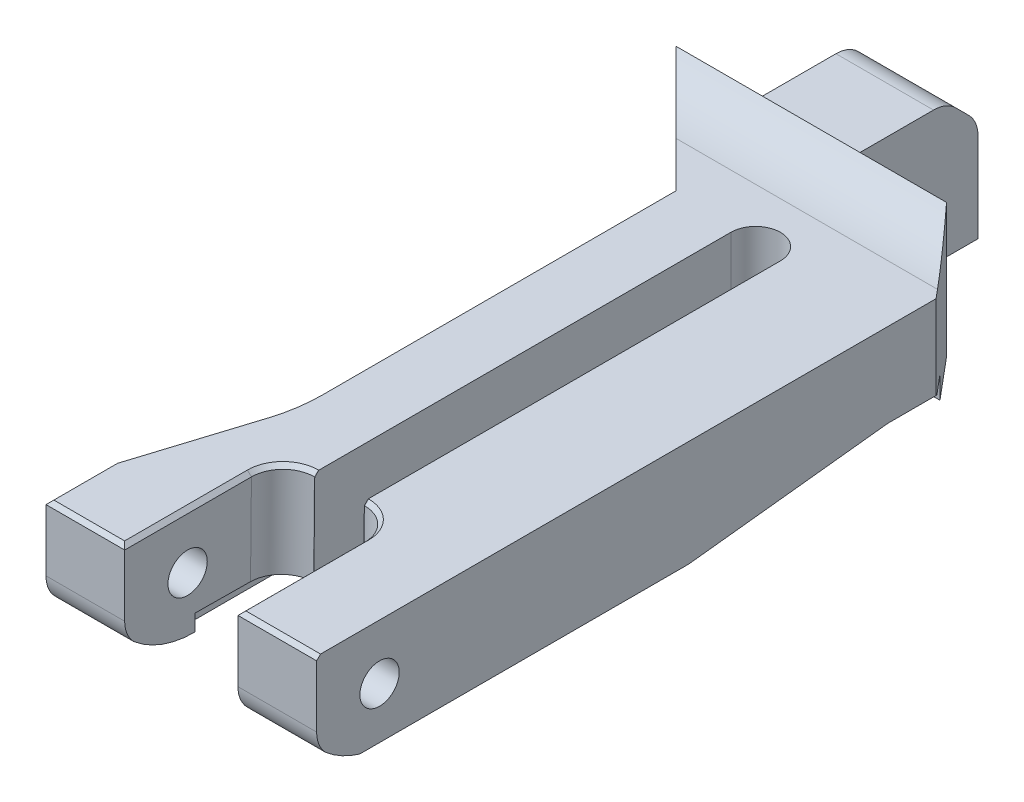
ISO-10303-21;
HEADER;
FILE_DESCRIPTION(('STEP AP214'),'2;1');
FILE_NAME('part.step','',(''),(''),'','','');
FILE_SCHEMA(('AUTOMOTIVE_DESIGN { 1 0 10303 214 1 1 1 1 }'));
ENDSEC;
DATA;
#1=APPLICATION_CONTEXT('core data for automotive mechanical design processes');
#2=APPLICATION_PROTOCOL_DEFINITION('international standard','automotive_design',2000,#1);
#3=PRODUCT_CONTEXT('',#1,'mechanical');
#4=PRODUCT('Part','Part','',(#3));
#5=PRODUCT_RELATED_PRODUCT_CATEGORY('part','',(#4));
#6=PRODUCT_DEFINITION_FORMATION('','',#4);
#7=PRODUCT_DEFINITION_CONTEXT('part definition',#1,'design');
#8=PRODUCT_DEFINITION('design','',#6,#7);
#9=PRODUCT_DEFINITION_SHAPE('','',#8);
#10=(LENGTH_UNIT() NAMED_UNIT(*) SI_UNIT(.MILLI.,.METRE.));
#11=(NAMED_UNIT(*) PLANE_ANGLE_UNIT() SI_UNIT($,.RADIAN.));
#12=(NAMED_UNIT(*) SI_UNIT($,.STERADIAN.) SOLID_ANGLE_UNIT());
#13=UNCERTAINTY_MEASURE_WITH_UNIT(LENGTH_MEASURE(1.E-05),#10,'distance_accuracy_value','');
#14=(GEOMETRIC_REPRESENTATION_CONTEXT(3) GLOBAL_UNCERTAINTY_ASSIGNED_CONTEXT((#13)) GLOBAL_UNIT_ASSIGNED_CONTEXT((#10,
#11,#12)) REPRESENTATION_CONTEXT('',''));
#15=CARTESIAN_POINT('',(0.,0.,0.));
#16=DIRECTION('',(0.,0.,1.));
#17=DIRECTION('',(1.,0.,0.));
#18=AXIS2_PLACEMENT_3D('',#15,#16,#17);
#19=CARTESIAN_POINT('',(-4.3,0.998405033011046,16.));
#20=DIRECTION('',(0.,-0.999951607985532,0.00983776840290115));
#21=DIRECTION('',(0.,-0.00983776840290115,-0.999951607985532));
#22=AXIS2_PLACEMENT_3D('',#19,#20,#21);
#23=PLANE('',#22);
#24=DIRECTION('',(0.,0.00983776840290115,0.999951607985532));
#25=VECTOR('',#24,1.);
#26=CARTESIAN_POINT('',(-1.575,0.840177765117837,-0.0828761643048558));
#27=LINE('',#26,#25);
#28=CARTESIAN_POINT('',(-1.575,0.868048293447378,2.75000000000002));
#29=VERTEX_POINT('',#28);
#30=CARTESIAN_POINT('',(-1.575,0.988567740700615,15.0000967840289));
#31=VERTEX_POINT('',#30);
#32=EDGE_CURVE('E500',#29,#31,#27,.T.);
#33=ORIENTED_EDGE('',*,*,#32,.T.);
#34=DIRECTION('',(1.,0.,0.));
#35=VECTOR('',#34,1.);
#36=CARTESIAN_POINT('',(0.,0.988567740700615,15.0000967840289));
#37=LINE('',#36,#35);
#38=CARTESIAN_POINT('',(-1.59999999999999,0.988567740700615,15.0000967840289));
#39=VERTEX_POINT('',#38);
#40=EDGE_CURVE('E507',#39,#31,#37,.T.);
#41=ORIENTED_EDGE('',*,*,#40,.F.);
#42=CARTESIAN_POINT('',(-1.6,1.00824327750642,17.));
#43=DIRECTION('',(0.,-0.999951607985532,0.00983776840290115));
#44=DIRECTION('',(0.,0.00983776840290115,0.999951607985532));
#45=AXIS2_PLACEMENT_3D('',#42,#43,#44);
#46=CIRCLE('',#45,2.);
#47=CARTESIAN_POINT('',(-3.6,1.00824327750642,17.));
#48=VERTEX_POINT('',#47);
#49=EDGE_CURVE('E508',#48,#39,#46,.T.);
#50=ORIENTED_EDGE('',*,*,#49,.F.);
#51=DIRECTION('',(0.,0.00983776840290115,0.999951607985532));
#52=VECTOR('',#51,1.);
#53=CARTESIAN_POINT('',(-3.6,1.08752150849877,25.058168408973));
#54=LINE('',#53,#52);
#55=CARTESIAN_POINT('',(-3.6,1.04312017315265,20.5450324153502));
#56=VERTEX_POINT('',#55);
#57=EDGE_CURVE('E1469',#48,#56,#54,.T.);
#58=ORIENTED_EDGE('',*,*,#57,.T.);
#59=DIRECTION('',(1.,0.,0.));
#60=VECTOR('',#59,1.);
#61=CARTESIAN_POINT('',(4.28192858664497,1.04312017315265,20.5450324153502));
#62=LINE('',#61,#60);
#63=CARTESIAN_POINT('',(-4.28192858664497,1.04312017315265,20.5450324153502));
#64=VERTEX_POINT('',#63);
#65=EDGE_CURVE('E1488',#64,#56,#62,.T.);
#66=ORIENTED_EDGE('',*,*,#65,.F.);
#67=DIRECTION('',(0.,0.00983776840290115,0.999951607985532));
#68=VECTOR('',#67,1.);
#69=CARTESIAN_POINT('',(-4.28192858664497,0.940785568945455,10.1433185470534));
#70=LINE('',#69,#68);
#71=CARTESIAN_POINT('',(-4.28191861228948,0.939466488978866,10.0092417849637));
#72=VERTEX_POINT('',#71);
#73=EDGE_CURVE('E1470',#72,#64,#70,.T.);
#74=ORIENTED_EDGE('',*,*,#73,.F.);
#75=CARTESIAN_POINT('',(0.,0.939375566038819,10.));
#76=DIRECTION('',(0.,0.999951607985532,-0.00983776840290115));
#77=DIRECTION('',(0.,-0.00983776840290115,-0.999951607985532));
#78=AXIS2_PLACEMENT_3D('',#75,#76,#77);
#79=CIRCLE('',#78,4.28192858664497);
#80=CARTESIAN_POINT('',(-4.28192858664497,0.939375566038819,10.));
#81=VERTEX_POINT('',#80);
#82=EDGE_CURVE('E776',#81,#72,#79,.T.);
#83=ORIENTED_EDGE('',*,*,#82,.F.);
#84=DIRECTION('',(1.,0.,0.));
#85=VECTOR('',#84,1.);
#86=CARTESIAN_POINT('',(-4.28192858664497,0.939375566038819,10.));
#87=LINE('',#86,#85);
#88=CARTESIAN_POINT('',(-4.3,0.939375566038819,10.));
#89=VERTEX_POINT('',#88);
#90=EDGE_CURVE('E788',#89,#81,#87,.T.);
#91=ORIENTED_EDGE('',*,*,#90,.F.);
#92=DIRECTION('',(0.,-0.00983776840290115,-0.999951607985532));
#93=VECTOR('',#92,1.);
#94=CARTESIAN_POINT('',(-4.3,0.998405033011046,16.));
#95=LINE('',#94,#93);
#96=CARTESIAN_POINT('',(-4.3,0.868048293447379,2.75000000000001));
#97=VERTEX_POINT('',#96);
#98=EDGE_CURVE('E928',#89,#97,#95,.T.);
#99=ORIENTED_EDGE('',*,*,#98,.T.);
#100=DIRECTION('',(1.,0.,0.));
#101=VECTOR('',#100,1.);
#102=CARTESIAN_POINT('',(-4.3,0.868048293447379,2.75000000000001));
#103=LINE('',#102,#101);
#104=EDGE_CURVE('E943',#97,#29,#103,.T.);
#105=ORIENTED_EDGE('',*,*,#104,.T.);
#106=EDGE_LOOP('',(#33,#41,#50,#58,#66,#74,#83,#91,#99,#105));
#107=FACE_BOUND('',#106,.T.);
#108=ADVANCED_FACE('F38',(#107),#23,.T.);
#109=CARTESIAN_POINT('',(0.,8.90260296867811,14.9222365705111));
#110=DIRECTION('',(0.,-0.00983776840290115,-0.999951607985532));
#111=DIRECTION('',(0.,0.999951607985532,-0.00983776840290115));
#112=AXIS2_PLACEMENT_3D('',#109,#110,#111);
#113=PLANE('',#112);
#114=DIRECTION('',(0.,0.999951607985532,-0.00983776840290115));
#115=VECTOR('',#114,1.);
#116=CARTESIAN_POINT('',(-1.575,8.90260296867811,14.9222365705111));
#117=LINE('',#116,#115);
#118=CARTESIAN_POINT('',(-1.575,6.75073649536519,14.943407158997));
#119=VERTEX_POINT('',#118);
#120=EDGE_CURVE('E489',#31,#119,#117,.T.);
#121=ORIENTED_EDGE('',*,*,#120,.T.);
#122=DIRECTION('',(-1.,0.,0.));
#123=VECTOR('',#122,1.);
#124=CARTESIAN_POINT('',(0.,6.75073649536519,14.943407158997));
#125=LINE('',#124,#123);
#126=CARTESIAN_POINT('',(-1.59999999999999,6.75073649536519,14.943407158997));
#127=VERTEX_POINT('',#126);
#128=EDGE_CURVE('E49',#119,#127,#125,.T.);
#129=ORIENTED_EDGE('',*,*,#128,.T.);
#130=DIRECTION('',(0.,-0.999951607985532,0.00983776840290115));
#131=VECTOR('',#130,1.);
#132=CARTESIAN_POINT('',(-1.59999999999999,8.90260296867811,14.9222365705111));
#133=LINE('',#132,#131);
#134=EDGE_CURVE('E1526',#127,#39,#133,.T.);
#135=ORIENTED_EDGE('',*,*,#134,.T.);
#136=ORIENTED_EDGE('',*,*,#40,.T.);
#137=EDGE_LOOP('',(#121,#129,#135,#136));
#138=FACE_BOUND('',#137,.T.);
#139=ADVANCED_FACE('F561',(#138),#113,.F.);
#140=CARTESIAN_POINT('',(-4.3,3.53755509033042,-12.1598306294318));
#141=DIRECTION('',(0.,-1.,0.));
#142=DIRECTION('',(0.,0.,-1.));
#143=AXIS2_PLACEMENT_3D('',#140,#141,#142);
#144=PLANE('',#143);
#145=CARTESIAN_POINT('',(0.,3.53755509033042,-11.5));
#146=DIRECTION('',(0.,-1.,0.));
#147=DIRECTION('',(0.,0.,-1.));
#148=AXIS2_PLACEMENT_3D('',#145,#146,#147);
#149=CIRCLE('',#148,2.);
#150=CARTESIAN_POINT('',(2.,3.53755509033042,-11.5));
#151=VERTEX_POINT('',#150);
#152=CARTESIAN_POINT('',(1.88802106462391,3.53755509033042,-12.1598306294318));
#153=VERTEX_POINT('',#152);
#154=EDGE_CURVE('E1305',#151,#153,#149,.F.);
#155=ORIENTED_EDGE('',*,*,#154,.F.);
#156=DIRECTION('',(1.,0.,0.));
#157=VECTOR('',#156,1.);
#158=CARTESIAN_POINT('',(1.575,3.53755509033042,-11.5));
#159=LINE('',#158,#157);
#160=CARTESIAN_POINT('',(1.575,3.53755509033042,-11.5));
#161=VERTEX_POINT('',#160);
#162=EDGE_CURVE('E1562',#161,#151,#159,.T.);
#163=ORIENTED_EDGE('',*,*,#162,.F.);
#164=CARTESIAN_POINT('',(0.,3.53755509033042,-11.5));
#165=DIRECTION('',(0.,-1.,0.));
#166=DIRECTION('',(0.,0.,-1.));
#167=AXIS2_PLACEMENT_3D('',#164,#165,#166);
#168=CIRCLE('',#167,1.575);
#169=CARTESIAN_POINT('',(-1.575,3.53755509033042,-11.5));
#170=VERTEX_POINT('',#169);
#171=EDGE_CURVE('E1497',#161,#170,#168,.F.);
#172=ORIENTED_EDGE('',*,*,#171,.T.);
#173=DIRECTION('',(1.,0.,0.));
#174=VECTOR('',#173,1.);
#175=CARTESIAN_POINT('',(-2.,3.53755509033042,-11.5));
#176=LINE('',#175,#174);
#177=CARTESIAN_POINT('',(-2.,3.53755509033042,-11.5));
#178=VERTEX_POINT('',#177);
#179=EDGE_CURVE('E1564',#178,#170,#176,.T.);
#180=ORIENTED_EDGE('',*,*,#179,.F.);
#181=CARTESIAN_POINT('',(-1.88802106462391,3.53755509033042,-12.1598306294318));
#182=VERTEX_POINT('',#181);
#183=EDGE_CURVE('E1477',#182,#178,#149,.F.);
#184=ORIENTED_EDGE('',*,*,#183,.F.);
#185=DIRECTION('',(1.,0.,0.));
#186=VECTOR('',#185,1.);
#187=CARTESIAN_POINT('',(-4.3,3.53755509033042,-12.1598306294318));
#188=LINE('',#187,#186);
#189=CARTESIAN_POINT('',(-4.24907325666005,3.53755509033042,-12.1598306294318));
#190=VERTEX_POINT('',#189);
#191=EDGE_CURVE('E939',#190,#182,#188,.T.);
#192=ORIENTED_EDGE('',*,*,#191,.F.);
#193=CARTESIAN_POINT('',(0.,3.53755509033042,-11.5));
#194=DIRECTION('',(0.,1.,0.));
#195=DIRECTION('',(0.,0.,-1.));
#196=AXIS2_PLACEMENT_3D('',#193,#194,#195);
#197=CIRCLE('',#196,4.3);
#198=CARTESIAN_POINT('',(4.24907325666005,3.53755509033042,-12.1598306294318));
#199=VERTEX_POINT('',#198);
#200=EDGE_CURVE('E868',#199,#190,#197,.T.);
#201=ORIENTED_EDGE('',*,*,#200,.F.);
#202=EDGE_CURVE('E938',#153,#199,#188,.T.);
#203=ORIENTED_EDGE('',*,*,#202,.F.);
#204=EDGE_LOOP('',(#155,#163,#172,#180,#184,#192,#201,#203));
#205=FACE_BOUND('',#204,.T.);
#206=ADVANCED_FACE('F1221',(#205),#144,.T.);
#207=CARTESIAN_POINT('',(0.,0.,0.));
#208=DIRECTION('',(0.,-1.,0.));
#209=DIRECTION('',(0.,0.,-1.));
#210=AXIS2_PLACEMENT_3D('',#207,#208,#209);
#211=PLANE('',#210);
#212=DIRECTION('',(0.,0.,1.));
#213=VECTOR('',#212,1.);
#214=CARTESIAN_POINT('',(4.28192858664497,0.,10.0092418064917));
#215=LINE('',#214,#213);
#216=CARTESIAN_POINT('',(4.28192858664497,0.,10.0092418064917));
#217=VERTEX_POINT('',#216);
#218=CARTESIAN_POINT('',(4.28192858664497,0.,20.5450324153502));
#219=VERTEX_POINT('',#218);
#220=EDGE_CURVE('E1454',#217,#219,#215,.T.);
#221=ORIENTED_EDGE('',*,*,#220,.F.);
#222=DIRECTION('',(0.984372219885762,0.,-0.176100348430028));
#223=VECTOR('',#222,1.);
#224=CARTESIAN_POINT('',(4.61817698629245,0.,9.94908828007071));
#225=LINE('',#224,#223);
#226=CARTESIAN_POINT('',(4.3,0.,10.0060089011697));
#227=VERTEX_POINT('',#226);
#228=EDGE_CURVE('E793',#217,#227,#225,.T.);
#229=ORIENTED_EDGE('',*,*,#228,.T.);
#230=DIRECTION('',(0.,0.,1.));
#231=VECTOR('',#230,1.);
#232=CARTESIAN_POINT('',(4.3,0.,-15.9));
#233=LINE('',#232,#231);
#234=CARTESIAN_POINT('',(4.3,0.,1.34025337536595));
#235=VERTEX_POINT('',#234);
#236=EDGE_CURVE('E914',#235,#227,#233,.T.);
#237=ORIENTED_EDGE('',*,*,#236,.F.);
#238=DIRECTION('',(-1.,0.,0.));
#239=VECTOR('',#238,1.);
#240=CARTESIAN_POINT('',(10.,0.,1.34025337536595));
#241=LINE('',#240,#239);
#242=CARTESIAN_POINT('',(8.35,0.,1.34025337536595));
#243=VERTEX_POINT('',#242);
#244=EDGE_CURVE('E896',#243,#235,#241,.T.);
#245=ORIENTED_EDGE('',*,*,#244,.F.);
#246=DIRECTION('',(0.,0.,1.));
#247=VECTOR('',#246,1.);
#248=CARTESIAN_POINT('',(8.35,0.,25.));
#249=LINE('',#248,#247);
#250=CARTESIAN_POINT('',(8.35,0.,20.5450324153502));
#251=VERTEX_POINT('',#250);
#252=EDGE_CURVE('E995',#243,#251,#249,.T.);
#253=ORIENTED_EDGE('',*,*,#252,.T.);
#254=DIRECTION('',(-1.,0.,0.));
#255=VECTOR('',#254,1.);
#256=CARTESIAN_POINT('',(3.6,0.,20.5450324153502));
#257=LINE('',#256,#255);
#258=EDGE_CURVE('E1096',#251,#219,#257,.T.);
#259=ORIENTED_EDGE('',*,*,#258,.T.);
#260=EDGE_LOOP('',(#221,#229,#237,#245,#253,#259));
#261=FACE_BOUND('',#260,.T.);
#262=ADVANCED_FACE('F1231',(#261),#211,.T.);
#263=CARTESIAN_POINT('',(0.,-11.2469852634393,10.1198923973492));
#264=DIRECTION('',(0.,0.999951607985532,-0.00983776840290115));
#265=DIRECTION('',(0.,0.00983776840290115,0.999951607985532));
#266=AXIS2_PLACEMENT_3D('',#263,#264,#265);
#267=CYLINDRICAL_SURFACE('',#266,4.28192858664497);
#268=ORIENTED_EDGE('',*,*,#82,.T.);
#269=DIRECTION('',(0.,-1.,0.));
#270=VECTOR('',#269,1.);
#271=CARTESIAN_POINT('',(-4.28192858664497,14.5689019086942,10.0092418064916));
#272=LINE('',#271,#270);
#273=CARTESIAN_POINT('',(-4.28192858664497,0.,10.0092418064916));
#274=VERTEX_POINT('',#273);
#275=EDGE_CURVE('E1447',#72,#274,#272,.T.);
#276=ORIENTED_EDGE('',*,*,#275,.T.);
#277=DIRECTION('',(0.,0.999951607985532,-0.00983776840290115));
#278=VECTOR('',#277,1.);
#279=CARTESIAN_POINT('',(-4.28192858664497,-11.2469852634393,10.1198923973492));
#280=LINE('',#279,#278);
#281=EDGE_CURVE('E791',#274,#81,#280,.T.);
#282=ORIENTED_EDGE('',*,*,#281,.T.);
#283=EDGE_LOOP('',(#268,#276,#282));
#284=FACE_BOUND('',#283,.T.);
#285=ADVANCED_FACE('F1411',(#284),#267,.F.);
#286=CARTESIAN_POINT('',(0.,0.,-11.5));
#287=DIRECTION('',(0.,1.,0.));
#288=DIRECTION('',(0.,0.,1.));
#289=AXIS2_PLACEMENT_3D('',#286,#287,#288);
#290=CYLINDRICAL_SURFACE('',#289,2.);
#291=CARTESIAN_POINT('',(0.,3.41941676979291,-11.5));
#292=DIRECTION('',(0.,-0.984347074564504,-0.176240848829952));
#293=DIRECTION('',(0.,0.176240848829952,-0.984347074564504));
#294=AXIS2_PLACEMENT_3D('',#291,#292,#293);
#295=ELLIPSE('',#294,2.03180367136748,2.);
#296=CARTESIAN_POINT('',(-2.,3.41941676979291,-11.5));
#297=VERTEX_POINT('',#296);
#298=EDGE_CURVE('E948',#182,#297,#295,.F.);
#299=ORIENTED_EDGE('',*,*,#298,.F.);
#300=ORIENTED_EDGE('',*,*,#183,.T.);
#301=DIRECTION('',(0.,1.,0.));
#302=VECTOR('',#301,1.);
#303=CARTESIAN_POINT('',(-2.,0.,-11.5));
#304=LINE('',#303,#302);
#305=EDGE_CURVE('E959',#297,#178,#304,.T.);
#306=ORIENTED_EDGE('',*,*,#305,.F.);
#307=EDGE_LOOP('',(#299,#300,#306));
#308=FACE_BOUND('',#307,.T.);
#309=ADVANCED_FACE('F760',(#308),#290,.F.);
#310=CARTESIAN_POINT('',(0.,7.,0.));
#311=DIRECTION('',(0.,-1.,0.));
#312=DIRECTION('',(0.,0.,-1.));
#313=AXIS2_PLACEMENT_3D('',#310,#311,#312);
#314=PLANE('',#313);
#315=DIRECTION('',(0.,0.,-1.));
#316=VECTOR('',#315,1.);
#317=CARTESIAN_POINT('',(1.575,7.,-11.5));
#318=LINE('',#317,#316);
#319=CARTESIAN_POINT('',(1.575,7.,14.6899167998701));
#320=VERTEX_POINT('',#319);
#321=CARTESIAN_POINT('',(1.575,7.,-11.5));
#322=VERTEX_POINT('',#321);
#323=EDGE_CURVE('E1491',#320,#322,#318,.T.);
#324=ORIENTED_EDGE('',*,*,#323,.F.);
#325=DIRECTION('',(1.,0.,0.));
#326=VECTOR('',#325,1.);
#327=CARTESIAN_POINT('',(0.,7.,14.6899167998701));
#328=LINE('',#327,#326);
#329=CARTESIAN_POINT('',(1.59999999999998,7.,14.6899167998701));
#330=VERTEX_POINT('',#329);
#331=EDGE_CURVE('E1535',#320,#330,#328,.T.);
#332=ORIENTED_EDGE('',*,*,#331,.T.);
#333=CARTESIAN_POINT('',(3.85350262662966,7.,16.943528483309));
#334=CARTESIAN_POINT('',(3.85351256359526,7.,16.7960291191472));
#335=CARTESIAN_POINT('',(3.83897651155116,7.,16.6485358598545));
#336=CARTESIAN_POINT('',(3.78142789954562,7.,16.3592054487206));
#337=CARTESIAN_POINT('',(3.73840778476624,7.,16.2173802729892));
#338=CARTESIAN_POINT('',(3.6255221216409,7.,15.9448369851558));
#339=CARTESIAN_POINT('',(3.55566124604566,7.,15.8141301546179));
#340=CARTESIAN_POINT('',(3.39177666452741,7.,15.5688476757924));
#341=CARTESIAN_POINT('',(3.29775974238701,7.,15.4542821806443));
#342=CARTESIAN_POINT('',(3.08917423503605,7.,15.2456865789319));
#343=CARTESIAN_POINT('',(2.97461428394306,7.,15.1516651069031));
#344=CARTESIAN_POINT('',(2.72934367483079,7.,14.987772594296));
#345=CARTESIAN_POINT('',(2.59864316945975,7.,14.9179083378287));
#346=CARTESIAN_POINT('',(2.326113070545,7.,14.8050172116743));
#347=CARTESIAN_POINT('',(2.18429475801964,7.,14.7619950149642));
#348=CARTESIAN_POINT('',(1.89497834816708,7.,14.7044436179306));
#349=CARTESIAN_POINT('',(1.74749222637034,7.,14.6899068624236));
#350=CARTESIAN_POINT('',(1.59999999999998,7.,14.6899167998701));
#351=B_SPLINE_CURVE_WITH_KNOTS('',3,(#333,#334,#335,#336,#337,#338,#339,#340,#341,#342,#343,
#344,#345,#346,#347,#348,#349,#350),.UNSPECIFIED.,.F.,.F.,(4,2,2,2,2,2,2,2,4),(3.14159265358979,
3.33794219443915,3.53429173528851,3.73064127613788,3.92699081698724,4.1233403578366,
4.31968989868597,4.51603943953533,4.7123889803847),.UNSPECIFIED.);
#352=CARTESIAN_POINT('',(3.85350262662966,7.,16.943528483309));
#353=VERTEX_POINT('',#352);
#354=EDGE_CURVE('E651',#330,#353,#351,.F.);
#355=ORIENTED_EDGE('',*,*,#354,.T.);
#356=DIRECTION('',(0.,0.,1.));
#357=VECTOR('',#356,1.);
#358=CARTESIAN_POINT('',(3.85350262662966,7.,0.));
#359=LINE('',#358,#357);
#360=CARTESIAN_POINT('',(3.85350262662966,7.,24.75));
#361=VERTEX_POINT('',#360);
#362=EDGE_CURVE('E737',#353,#361,#359,.T.);
#363=ORIENTED_EDGE('',*,*,#362,.T.);
#364=DIRECTION('',(1.,0.,0.));
#365=VECTOR('',#364,1.);
#366=CARTESIAN_POINT('',(0.,7.,24.75));
#367=LINE('',#366,#365);
#368=CARTESIAN_POINT('',(8.6,7.,24.75));
#369=VERTEX_POINT('',#368);
#370=EDGE_CURVE('E1054',#361,#369,#367,.T.);
#371=ORIENTED_EDGE('',*,*,#370,.T.);
#372=DIRECTION('',(0.,0.,-1.));
#373=VECTOR('',#372,1.);
#374=CARTESIAN_POINT('',(8.6,7.,25.));
#375=LINE('',#374,#373);
#376=CARTESIAN_POINT('',(8.6,7.,-14.3716444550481));
#377=VERTEX_POINT('',#376);
#378=EDGE_CURVE('E962',#369,#377,#375,.T.);
#379=ORIENTED_EDGE('',*,*,#378,.T.);
#380=DIRECTION('',(0.642787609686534,0.,0.766044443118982));
#381=VECTOR('',#380,1.);
#382=CARTESIAN_POINT('',(12.123340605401,7.,-10.1726906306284));
#383=LINE('',#382,#381);
#384=CARTESIAN_POINT('',(8.13208336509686,7.,-14.9292857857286));
#385=VERTEX_POINT('',#384);
#386=EDGE_CURVE('E824',#385,#377,#383,.T.);
#387=ORIENTED_EDGE('',*,*,#386,.F.);
#388=DIRECTION('',(-1.,0.,0.));
#389=VECTOR('',#388,1.);
#390=CARTESIAN_POINT('',(0.,7.,-14.9292857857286));
#391=LINE('',#390,#389);
#392=CARTESIAN_POINT('',(-8.49338740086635,7.,-14.9292857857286));
#393=VERTEX_POINT('',#392);
#394=EDGE_CURVE('E1117',#385,#393,#391,.T.);
#395=ORIENTED_EDGE('',*,*,#394,.T.);
#396=DIRECTION('',(0.707106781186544,0.,0.707106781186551));
#397=VECTOR('',#396,1.);
#398=CARTESIAN_POINT('',(-5.6,7.,-12.0358983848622));
#399=LINE('',#398,#397);
#400=CARTESIAN_POINT('',(-5.6,7.,-12.0358983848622));
#401=VERTEX_POINT('',#400);
#402=EDGE_CURVE('E853',#393,#401,#399,.T.);
#403=ORIENTED_EDGE('',*,*,#402,.T.);
#404=DIRECTION('',(0.,0.,-1.));
#405=VECTOR('',#404,1.);
#406=CARTESIAN_POINT('',(-5.6,7.,-18.5));
#407=LINE('',#406,#405);
#408=CARTESIAN_POINT('',(-5.6,7.,10.4252480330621));
#409=VERTEX_POINT('',#408);
#410=EDGE_CURVE('E951',#409,#401,#407,.T.);
#411=ORIENTED_EDGE('',*,*,#410,.F.);
#412=CARTESIAN_POINT('',(-15.6,7.,10.4252480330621));
#413=DIRECTION('',(0.,-1.,0.));
#414=DIRECTION('',(0.,0.,-1.));
#415=AXIS2_PLACEMENT_3D('',#412,#413,#414);
#416=CIRCLE('',#415,10.);
#417=CARTESIAN_POINT('',(-6.06060798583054,7.,13.4252480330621));
#418=VERTEX_POINT('',#417);
#419=EDGE_CURVE('E982',#409,#418,#416,.T.);
#420=ORIENTED_EDGE('',*,*,#419,.T.);
#421=DIRECTION('',(0.3,0.,-0.953939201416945));
#422=VECTOR('',#421,1.);
#423=CARTESIAN_POINT('',(-5.6,7.,11.9606079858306));
#424=LINE('',#423,#422);
#425=CARTESIAN_POINT('',(-8.35,7.,20.7050506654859));
#426=VERTEX_POINT('',#425);
#427=EDGE_CURVE('E949',#426,#418,#424,.T.);
#428=ORIENTED_EDGE('',*,*,#427,.F.);
#429=DIRECTION('',(0.,0.,1.));
#430=VECTOR('',#429,1.);
#431=CARTESIAN_POINT('',(-8.35,7.,0.));
#432=LINE('',#431,#430);
#433=CARTESIAN_POINT('',(-8.35,7.,24.75));
#434=VERTEX_POINT('',#433);
#435=EDGE_CURVE('E1049',#426,#434,#432,.T.);
#436=ORIENTED_EDGE('',*,*,#435,.T.);
#437=DIRECTION('',(1.,0.,0.));
#438=VECTOR('',#437,1.);
#439=CARTESIAN_POINT('',(0.,7.,24.75));
#440=LINE('',#439,#438);
#441=CARTESIAN_POINT('',(-3.85350262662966,7.,24.75));
#442=VERTEX_POINT('',#441);
#443=EDGE_CURVE('E734',#434,#442,#440,.T.);
#444=ORIENTED_EDGE('',*,*,#443,.T.);
#445=DIRECTION('',(0.,0.,-1.));
#446=VECTOR('',#445,1.);
#447=CARTESIAN_POINT('',(-3.85350262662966,7.,0.));
#448=LINE('',#447,#446);
#449=CARTESIAN_POINT('',(-3.85350262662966,7.,16.9435284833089));
#450=VERTEX_POINT('',#449);
#451=EDGE_CURVE('E730',#442,#450,#448,.T.);
#452=ORIENTED_EDGE('',*,*,#451,.T.);
#453=CARTESIAN_POINT('',(-1.59999999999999,7.,14.6899167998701));
#454=CARTESIAN_POINT('',(-1.74749222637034,7.,14.6899068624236));
#455=CARTESIAN_POINT('',(-1.89497834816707,7.,14.7044436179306));
#456=CARTESIAN_POINT('',(-2.18429475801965,7.,14.7619950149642));
#457=CARTESIAN_POINT('',(-2.32611307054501,7.,14.8050172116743));
#458=CARTESIAN_POINT('',(-2.59864316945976,7.,14.9179083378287));
#459=CARTESIAN_POINT('',(-2.72934367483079,7.,14.987772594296));
#460=CARTESIAN_POINT('',(-2.97461428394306,7.,15.1516651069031));
#461=CARTESIAN_POINT('',(-3.08917423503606,7.,15.2456865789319));
#462=CARTESIAN_POINT('',(-3.29775974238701,7.,15.4542821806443));
#463=CARTESIAN_POINT('',(-3.39177666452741,7.,15.5688476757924));
#464=CARTESIAN_POINT('',(-3.55566124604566,7.,15.8141301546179));
#465=CARTESIAN_POINT('',(-3.62552212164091,7.,15.9448369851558));
#466=CARTESIAN_POINT('',(-3.73840778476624,7.,16.2173802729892));
#467=CARTESIAN_POINT('',(-3.78142789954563,7.,16.3592054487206));
#468=CARTESIAN_POINT('',(-3.83897651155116,7.,16.6485358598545));
#469=CARTESIAN_POINT('',(-3.85351256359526,7.,16.7960291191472));
#470=CARTESIAN_POINT('',(-3.85350262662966,7.,16.9435284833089));
#471=B_SPLINE_CURVE_WITH_KNOTS('',3,(#453,#454,#455,#456,#457,#458,#459,#460,#461,#462,#463,
#464,#465,#466,#467,#468,#469,#470),.UNSPECIFIED.,.F.,.F.,(4,2,2,2,2,2,2,2,4),(1.57079632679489,
1.76714586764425,1.96349540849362,2.15984494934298,2.35619449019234,2.55254403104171,
2.74889357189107,2.94524311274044,3.1415926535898),.UNSPECIFIED.);
#472=CARTESIAN_POINT('',(-1.59999999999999,7.,14.6899167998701));
#473=VERTEX_POINT('',#472);
#474=EDGE_CURVE('E724',#450,#473,#471,.F.);
#475=ORIENTED_EDGE('',*,*,#474,.T.);
#476=DIRECTION('',(1.,0.,0.));
#477=VECTOR('',#476,1.);
#478=CARTESIAN_POINT('',(0.,7.,14.6899167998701));
#479=LINE('',#478,#477);
#480=CARTESIAN_POINT('',(-1.575,7.,14.6899167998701));
#481=VERTEX_POINT('',#480);
#482=EDGE_CURVE('E728',#473,#481,#479,.T.);
#483=ORIENTED_EDGE('',*,*,#482,.T.);
#484=DIRECTION('',(0.,0.,1.));
#485=VECTOR('',#484,1.);
#486=CARTESIAN_POINT('',(-1.575,7.,-11.5));
#487=LINE('',#486,#485);
#488=CARTESIAN_POINT('',(-1.575,7.,-11.5));
#489=VERTEX_POINT('',#488);
#490=EDGE_CURVE('E1495',#489,#481,#487,.T.);
#491=ORIENTED_EDGE('',*,*,#490,.F.);
#492=CARTESIAN_POINT('',(0.,7.,-11.5));
#493=DIRECTION('',(0.,1.,0.));
#494=DIRECTION('',(0.,0.,1.));
#495=AXIS2_PLACEMENT_3D('',#492,#493,#494);
#496=CIRCLE('',#495,1.575);
#497=EDGE_CURVE('E1494',#322,#489,#496,.T.);
#498=ORIENTED_EDGE('',*,*,#497,.F.);
#499=EDGE_LOOP('',(#324,#332,#355,#363,#371,#379,#387,#395,#403,#411,#420,#428,#436,#444,#452,
#475,#483,#491,#498));
#500=FACE_BOUND('',#499,.T.);
#501=ADVANCED_FACE('F732',(#500),#314,.F.);
#502=CARTESIAN_POINT('',(-6.56410161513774,0.,0.));
#503=DIRECTION('',(1.,0.,0.));
#504=DIRECTION('',(0.,0.,-1.));
#505=AXIS2_PLACEMENT_3D('',#502,#503,#504);
#506=PLANE('',#505);
#507=CARTESIAN_POINT('',(-6.56410161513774,3.50000000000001,-21.5));
#508=DIRECTION('',(1.,0.,0.));
#509=DIRECTION('',(0.,0.,-1.));
#510=AXIS2_PLACEMENT_3D('',#507,#508,#509);
#511=CIRCLE('',#510,1.2);
#512=CARTESIAN_POINT('',(-6.56410161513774,3.50000000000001,-22.7));
#513=VERTEX_POINT('',#512);
#514=EDGE_CURVE('E809',#513,#513,#511,.T.);
#515=ORIENTED_EDGE('',*,*,#514,.T.);
#516=EDGE_LOOP('',(#515));
#517=FACE_BOUND('',#516,.T.);
#518=DIRECTION('',(0.,1.,0.));
#519=VECTOR('',#518,1.);
#520=CARTESIAN_POINT('',(-6.56410161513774,0.,-18.5));
#521=LINE('',#520,#519);
#522=CARTESIAN_POINT('',(-6.56410161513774,0.,-18.5));
#523=VERTEX_POINT('',#522);
#524=CARTESIAN_POINT('',(-6.56410161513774,8.5,-18.5));
#525=VERTEX_POINT('',#524);
#526=EDGE_CURVE('E851',#523,#525,#521,.T.);
#527=ORIENTED_EDGE('',*,*,#526,.T.);
#528=DIRECTION('',(0.,0.,-1.));
#529=VECTOR('',#528,1.);
#530=CARTESIAN_POINT('',(-6.56410161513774,8.5,-18.5));
#531=LINE('',#530,#529);
#532=CARTESIAN_POINT('',(-6.56410161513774,8.5,-23.1715728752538));
#533=VERTEX_POINT('',#532);
#534=EDGE_CURVE('E1149',#525,#533,#531,.T.);
#535=ORIENTED_EDGE('',*,*,#534,.T.);
#536=CARTESIAN_POINT('',(-6.56410161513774,6.5,-23.1715728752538));
#537=DIRECTION('',(1.,0.,0.));
#538=DIRECTION('',(0.,0.,-1.));
#539=AXIS2_PLACEMENT_3D('',#536,#537,#538);
#540=CIRCLE('',#539,2.);
#541=CARTESIAN_POINT('',(-6.56410161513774,7.9142135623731,-24.5857864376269));
#542=VERTEX_POINT('',#541);
#543=EDGE_CURVE('E1138',#533,#542,#540,.F.);
#544=ORIENTED_EDGE('',*,*,#543,.T.);
#545=DIRECTION('',(0.,0.707106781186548,0.707106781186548));
#546=VECTOR('',#545,1.);
#547=CARTESIAN_POINT('',(-6.56410161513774,8.5,-24.));
#548=LINE('',#547,#546);
#549=CARTESIAN_POINT('',(-6.56410161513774,7.0857864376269,-25.4142135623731));
#550=VERTEX_POINT('',#549);
#551=EDGE_CURVE('E1121',#542,#550,#548,.F.);
#552=ORIENTED_EDGE('',*,*,#551,.T.);
#553=CARTESIAN_POINT('',(-6.56410161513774,5.67157287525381,-24.));
#554=DIRECTION('',(1.,0.,0.));
#555=DIRECTION('',(0.,0.,-1.));
#556=AXIS2_PLACEMENT_3D('',#553,#554,#555);
#557=CIRCLE('',#556,2.);
#558=CARTESIAN_POINT('',(-6.56410161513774,5.67157287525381,-26.));
#559=VERTEX_POINT('',#558);
#560=EDGE_CURVE('E1140',#550,#559,#557,.F.);
#561=ORIENTED_EDGE('',*,*,#560,.T.);
#562=DIRECTION('',(0.,-1.,0.));
#563=VECTOR('',#562,1.);
#564=CARTESIAN_POINT('',(-6.56410161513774,8.5,-26.));
#565=LINE('',#564,#563);
#566=CARTESIAN_POINT('',(-6.56410161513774,0.,-26.));
#567=VERTEX_POINT('',#566);
#568=EDGE_CURVE('E1158',#559,#567,#565,.T.);
#569=ORIENTED_EDGE('',*,*,#568,.T.);
#570=DIRECTION('',(0.,0.,-1.));
#571=VECTOR('',#570,1.);
#572=CARTESIAN_POINT('',(-6.56410161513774,0.,0.));
#573=LINE('',#572,#571);
#574=EDGE_CURVE('E848',#523,#567,#573,.T.);
#575=ORIENTED_EDGE('',*,*,#574,.F.);
#576=EDGE_LOOP('',(#527,#535,#544,#552,#561,#569,#575));
#577=FACE_BOUND('',#576,.T.);
#578=ADVANCED_FACE('F759',(#517,#577),#506,.F.);
#579=CARTESIAN_POINT('',(-0.364101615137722,0.,0.));
#580=DIRECTION('',(-1.,0.,0.));
#581=DIRECTION('',(0.,0.,1.));
#582=AXIS2_PLACEMENT_3D('',#579,#580,#581);
#583=PLANE('',#582);
#584=CARTESIAN_POINT('',(-0.364101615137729,3.50000000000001,-21.5));
#585=DIRECTION('',(-1.,0.,0.));
#586=DIRECTION('',(0.,0.,1.));
#587=AXIS2_PLACEMENT_3D('',#584,#585,#586);
#588=CIRCLE('',#587,1.2);
#589=CARTESIAN_POINT('',(-0.364101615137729,3.50000000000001,-20.3));
#590=VERTEX_POINT('',#589);
#591=EDGE_CURVE('E808',#590,#590,#588,.T.);
#592=ORIENTED_EDGE('',*,*,#591,.T.);
#593=EDGE_LOOP('',(#592));
#594=FACE_BOUND('',#593,.T.);
#595=DIRECTION('',(0.,0.,1.));
#596=VECTOR('',#595,1.);
#597=CARTESIAN_POINT('',(-0.364101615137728,8.5,-18.5));
#598=LINE('',#597,#596);
#599=CARTESIAN_POINT('',(-0.364101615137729,8.5,-23.1715728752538));
#600=VERTEX_POINT('',#599);
#601=CARTESIAN_POINT('',(-0.364101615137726,8.5,-18.5));
#602=VERTEX_POINT('',#601);
#603=EDGE_CURVE('E1152',#600,#602,#598,.T.);
#604=ORIENTED_EDGE('',*,*,#603,.T.);
#605=DIRECTION('',(0.,1.,0.));
#606=VECTOR('',#605,1.);
#607=CARTESIAN_POINT('',(-0.364101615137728,0.,-18.5));
#608=LINE('',#607,#606);
#609=CARTESIAN_POINT('',(-0.364101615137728,0.,-18.5));
#610=VERTEX_POINT('',#609);
#611=EDGE_CURVE('E835',#610,#602,#608,.T.);
#612=ORIENTED_EDGE('',*,*,#611,.F.);
#613=DIRECTION('',(0.,0.,1.));
#614=VECTOR('',#613,1.);
#615=CARTESIAN_POINT('',(-0.364101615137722,0.,0.));
#616=LINE('',#615,#614);
#617=CARTESIAN_POINT('',(-0.364101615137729,0.,-26.));
#618=VERTEX_POINT('',#617);
#619=EDGE_CURVE('E831',#618,#610,#616,.T.);
#620=ORIENTED_EDGE('',*,*,#619,.F.);
#621=DIRECTION('',(0.,1.,0.));
#622=VECTOR('',#621,1.);
#623=CARTESIAN_POINT('',(-0.364101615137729,8.5,-26.));
#624=LINE('',#623,#622);
#625=CARTESIAN_POINT('',(-0.364101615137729,5.67157287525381,-26.));
#626=VERTEX_POINT('',#625);
#627=EDGE_CURVE('E792',#618,#626,#624,.T.);
#628=ORIENTED_EDGE('',*,*,#627,.T.);
#629=CARTESIAN_POINT('',(-0.364101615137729,5.67157287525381,-24.));
#630=DIRECTION('',(-1.,0.,0.));
#631=DIRECTION('',(0.,0.,1.));
#632=AXIS2_PLACEMENT_3D('',#629,#630,#631);
#633=CIRCLE('',#632,2.);
#634=CARTESIAN_POINT('',(-0.36410161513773,7.0857864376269,-25.4142135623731));
#635=VERTEX_POINT('',#634);
#636=EDGE_CURVE('E1132',#626,#635,#633,.F.);
#637=ORIENTED_EDGE('',*,*,#636,.T.);
#638=DIRECTION('',(0.,-0.707106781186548,-0.707106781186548));
#639=VECTOR('',#638,1.);
#640=CARTESIAN_POINT('',(-0.364101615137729,8.5,-24.));
#641=LINE('',#640,#639);
#642=CARTESIAN_POINT('',(-0.364101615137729,7.9142135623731,-24.5857864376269));
#643=VERTEX_POINT('',#642);
#644=EDGE_CURVE('E1124',#635,#643,#641,.F.);
#645=ORIENTED_EDGE('',*,*,#644,.T.);
#646=CARTESIAN_POINT('',(-0.364101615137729,6.5,-23.1715728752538));
#647=DIRECTION('',(-1.,0.,0.));
#648=DIRECTION('',(0.,0.,1.));
#649=AXIS2_PLACEMENT_3D('',#646,#647,#648);
#650=CIRCLE('',#649,2.);
#651=EDGE_CURVE('E1130',#643,#600,#650,.F.);
#652=ORIENTED_EDGE('',*,*,#651,.T.);
#653=EDGE_LOOP('',(#604,#612,#620,#628,#637,#645,#652));
#654=FACE_BOUND('',#653,.T.);
#655=ADVANCED_FACE('F1190',(#594,#654),#583,.F.);
#656=CARTESIAN_POINT('',(-4.3,0.,0.));
#657=DIRECTION('',(-1.,0.,0.));
#658=DIRECTION('',(0.,0.,1.));
#659=AXIS2_PLACEMENT_3D('',#656,#657,#658);
#660=PLANE('',#659);
#661=DIRECTION('',(0.,0.999951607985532,-0.00983776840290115));
#662=VECTOR('',#661,1.);
#663=CARTESIAN_POINT('',(-4.3,0.0984638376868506,10.0082730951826));
#664=LINE('',#663,#662);
#665=CARTESIAN_POINT('',(-4.3,0.,10.0092418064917));
#666=VERTEX_POINT('',#665);
#667=EDGE_CURVE('E806',#666,#89,#664,.T.);
#668=ORIENTED_EDGE('',*,*,#667,.F.);
#669=DIRECTION('',(0.,0.,1.));
#670=VECTOR('',#669,1.);
#671=CARTESIAN_POINT('',(-4.3,0.,-15.9));
#672=LINE('',#671,#670);
#673=CARTESIAN_POINT('',(-4.3,0.,1.34025337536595));
#674=VERTEX_POINT('',#673);
#675=EDGE_CURVE('E925',#674,#666,#672,.T.);
#676=ORIENTED_EDGE('',*,*,#675,.F.);
#677=DIRECTION('',(0.,-0.111459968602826,0.99376892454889));
#678=VECTOR('',#677,1.);
#679=CARTESIAN_POINT('',(-4.3,0.148453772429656,0.0166504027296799));
#680=LINE('',#679,#678);
#681=CARTESIAN_POINT('',(-4.3,1.42,-11.3203627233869));
#682=VERTEX_POINT('',#681);
#683=EDGE_CURVE('E905',#682,#674,#680,.T.);
#684=ORIENTED_EDGE('',*,*,#683,.F.);
#685=DIRECTION('',(0.,0.,1.));
#686=VECTOR('',#685,1.);
#687=CARTESIAN_POINT('',(-4.3,1.42,0.));
#688=LINE('',#687,#686);
#689=CARTESIAN_POINT('',(-4.3,1.42,-11.5));
#690=VERTEX_POINT('',#689);
#691=EDGE_CURVE('E907',#690,#682,#688,.T.);
#692=ORIENTED_EDGE('',*,*,#691,.F.);
#693=DIRECTION('',(0.,1.,0.));
#694=VECTOR('',#693,1.);
#695=CARTESIAN_POINT('',(-4.3,-8.24022774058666,-11.5));
#696=LINE('',#695,#694);
#697=CARTESIAN_POINT('',(-4.3,3.41941676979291,-11.5));
#698=VERTEX_POINT('',#697);
#699=EDGE_CURVE('E870',#690,#698,#696,.T.);
#700=ORIENTED_EDGE('',*,*,#699,.T.);
#701=DIRECTION('',(0.,0.176240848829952,-0.984347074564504));
#702=VECTOR('',#701,1.);
#703=CARTESIAN_POINT('',(-4.3,0.868048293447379,2.75000000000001));
#704=LINE('',#703,#702);
#705=EDGE_CURVE('E930',#97,#698,#704,.T.);
#706=ORIENTED_EDGE('',*,*,#705,.F.);
#707=ORIENTED_EDGE('',*,*,#98,.F.);
#708=EDGE_LOOP('',(#668,#676,#684,#692,#700,#706,#707));
#709=FACE_BOUND('',#708,.T.);
#710=ADVANCED_FACE('F1232',(#709),#660,.F.);
#711=CARTESIAN_POINT('',(4.3,0.,0.));
#712=DIRECTION('',(-1.,0.,0.));
#713=DIRECTION('',(0.,0.,1.));
#714=AXIS2_PLACEMENT_3D('',#711,#712,#713);
#715=PLANE('',#714);
#716=ORIENTED_EDGE('',*,*,#236,.T.);
#717=DIRECTION('',(0.,0.999951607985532,-0.00983776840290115));
#718=VECTOR('',#717,1.);
#719=CARTESIAN_POINT('',(4.3,0.0984320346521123,10.0050405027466));
#720=LINE('',#719,#718);
#721=CARTESIAN_POINT('',(4.3,0.939343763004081,9.9967674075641));
#722=VERTEX_POINT('',#721);
#723=EDGE_CURVE('E796',#227,#722,#720,.T.);
#724=ORIENTED_EDGE('',*,*,#723,.T.);
#725=DIRECTION('',(0.,-0.00983776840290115,-0.999951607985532));
#726=VECTOR('',#725,1.);
#727=CARTESIAN_POINT('',(4.3,0.998405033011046,16.));
#728=LINE('',#727,#726);
#729=CARTESIAN_POINT('',(4.3,0.868048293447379,2.75000000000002));
#730=VERTEX_POINT('',#729);
#731=EDGE_CURVE('E917',#722,#730,#728,.T.);
#732=ORIENTED_EDGE('',*,*,#731,.T.);
#733=DIRECTION('',(0.,0.176240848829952,-0.984347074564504));
#734=VECTOR('',#733,1.);
#735=CARTESIAN_POINT('',(4.3,0.868048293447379,2.75000000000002));
#736=LINE('',#735,#734);
#737=CARTESIAN_POINT('',(4.3,3.41941676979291,-11.5));
#738=VERTEX_POINT('',#737);
#739=EDGE_CURVE('E919',#730,#738,#736,.T.);
#740=ORIENTED_EDGE('',*,*,#739,.T.);
#741=DIRECTION('',(0.,1.,0.));
#742=VECTOR('',#741,1.);
#743=CARTESIAN_POINT('',(4.3,-8.24022774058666,-11.5));
#744=LINE('',#743,#742);
#745=CARTESIAN_POINT('',(4.3,1.42,-11.5));
#746=VERTEX_POINT('',#745);
#747=EDGE_CURVE('E865',#746,#738,#744,.T.);
#748=ORIENTED_EDGE('',*,*,#747,.F.);
#749=DIRECTION('',(0.,0.,1.));
#750=VECTOR('',#749,1.);
#751=CARTESIAN_POINT('',(4.3,1.42,0.));
#752=LINE('',#751,#750);
#753=CARTESIAN_POINT('',(4.3,1.42,-11.3203627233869));
#754=VERTEX_POINT('',#753);
#755=EDGE_CURVE('E988',#746,#754,#752,.T.);
#756=ORIENTED_EDGE('',*,*,#755,.T.);
#757=DIRECTION('',(0.,-0.111459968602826,0.99376892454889));
#758=VECTOR('',#757,1.);
#759=CARTESIAN_POINT('',(4.3,0.148453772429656,0.0166504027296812));
#760=LINE('',#759,#758);
#761=EDGE_CURVE('E985',#754,#235,#760,.T.);
#762=ORIENTED_EDGE('',*,*,#761,.T.);
#763=EDGE_LOOP('',(#716,#724,#732,#740,#748,#756,#762));
#764=FACE_BOUND('',#763,.T.);
#765=ADVANCED_FACE('F1225',(#764),#715,.T.);
#766=CARTESIAN_POINT('',(1.575,0.988567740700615,15.0000967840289));
#767=VERTEX_POINT('',#766);
#768=CARTESIAN_POINT('',(1.59999999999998,0.988567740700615,15.0000967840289));
#769=VERTEX_POINT('',#768);
#770=EDGE_CURVE('E483',#767,#769,#37,.T.);
#771=ORIENTED_EDGE('',*,*,#770,.F.);
#772=DIRECTION('',(0.,-0.00983776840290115,-0.999951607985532));
#773=VECTOR('',#772,1.);
#774=CARTESIAN_POINT('',(1.575,0.840177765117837,-0.0828761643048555));
#775=LINE('',#774,#773);
#776=CARTESIAN_POINT('',(1.575,0.868048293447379,2.75000000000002));
#777=VERTEX_POINT('',#776);
#778=EDGE_CURVE('E493',#767,#777,#775,.T.);
#779=ORIENTED_EDGE('',*,*,#778,.T.);
#780=EDGE_CURVE('E942',#777,#730,#103,.T.);
#781=ORIENTED_EDGE('',*,*,#780,.T.);
#782=ORIENTED_EDGE('',*,*,#731,.F.);
#783=DIRECTION('',(0.984373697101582,-0.00173235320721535,-0.176083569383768));
#784=VECTOR('',#783,1.);
#785=CARTESIAN_POINT('',(4.6373591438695,0.938750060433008,9.93642101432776));
#786=LINE('',#785,#784);
#787=CARTESIAN_POINT('',(4.28192858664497,0.939375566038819,10.));
#788=VERTEX_POINT('',#787);
#789=EDGE_CURVE('E786',#788,#722,#786,.T.);
#790=ORIENTED_EDGE('',*,*,#789,.F.);
#791=CARTESIAN_POINT('',(4.28192858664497,0.939466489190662,10.0092418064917));
#792=VERTEX_POINT('',#791);
#793=EDGE_CURVE('E781',#792,#788,#79,.T.);
#794=ORIENTED_EDGE('',*,*,#793,.F.);
#795=DIRECTION('',(0.,-0.00983776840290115,-0.999951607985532));
#796=VECTOR('',#795,1.);
#797=CARTESIAN_POINT('',(4.28192858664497,0.940785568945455,10.1433185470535));
#798=LINE('',#797,#796);
#799=CARTESIAN_POINT('',(4.28192858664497,1.04312017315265,20.5450324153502));
#800=VERTEX_POINT('',#799);
#801=EDGE_CURVE('E1436',#800,#792,#798,.T.);
#802=ORIENTED_EDGE('',*,*,#801,.F.);
#803=CARTESIAN_POINT('',(3.6,1.04312017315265,20.5450324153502));
#804=VERTEX_POINT('',#803);
#805=EDGE_CURVE('E1444',#804,#800,#62,.T.);
#806=ORIENTED_EDGE('',*,*,#805,.F.);
#807=DIRECTION('',(0.,-0.00983776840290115,-0.999951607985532));
#808=VECTOR('',#807,1.);
#809=CARTESIAN_POINT('',(3.6,1.08752150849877,25.058168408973));
#810=LINE('',#809,#808);
#811=CARTESIAN_POINT('',(3.6,1.00824327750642,17.));
#812=VERTEX_POINT('',#811);
#813=EDGE_CURVE('E1467',#804,#812,#810,.T.);
#814=ORIENTED_EDGE('',*,*,#813,.T.);
#815=CARTESIAN_POINT('',(1.6,1.00824327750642,17.));
#816=DIRECTION('',(0.,-0.999951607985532,0.00983776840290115));
#817=DIRECTION('',(0.,-0.00983776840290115,-0.999951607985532));
#818=AXIS2_PLACEMENT_3D('',#815,#816,#817);
#819=CIRCLE('',#818,2.);
#820=EDGE_CURVE('E506',#769,#812,#819,.T.);
#821=ORIENTED_EDGE('',*,*,#820,.F.);
#822=EDGE_LOOP('',(#771,#779,#781,#782,#790,#794,#802,#806,#814,#821));
#823=FACE_BOUND('',#822,.T.);
#824=ADVANCED_FACE('F503',(#823),#23,.T.);
#825=ORIENTED_EDGE('',*,*,#574,.T.);
#826=DIRECTION('',(-1.,0.,0.));
#827=VECTOR('',#826,1.);
#828=CARTESIAN_POINT('',(10.9716824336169,0.,-26.));
#829=LINE('',#828,#827);
#830=EDGE_CURVE('E1169',#618,#567,#829,.T.);
#831=ORIENTED_EDGE('',*,*,#830,.F.);
#832=ORIENTED_EDGE('',*,*,#619,.T.);
#833=DIRECTION('',(1.,0.,0.));
#834=VECTOR('',#833,1.);
#835=CARTESIAN_POINT('',(0.,0.,-18.5));
#836=LINE('',#835,#834);
#837=CARTESIAN_POINT('',(5.13589838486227,0.,-18.5));
#838=VERTEX_POINT('',#837);
#839=EDGE_CURVE('E825',#610,#838,#836,.T.);
#840=ORIENTED_EDGE('',*,*,#839,.T.);
#841=DIRECTION('',(0.642787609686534,0.,0.766044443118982));
#842=VECTOR('',#841,1.);
#843=CARTESIAN_POINT('',(12.123340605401,0.,-10.1726906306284));
#844=LINE('',#843,#842);
#845=CARTESIAN_POINT('',(7.31755742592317,0.,-15.9));
#846=VERTEX_POINT('',#845);
#847=EDGE_CURVE('E828',#838,#846,#844,.T.);
#848=ORIENTED_EDGE('',*,*,#847,.T.);
#849=DIRECTION('',(-1.,0.,0.));
#850=VECTOR('',#849,1.);
#851=CARTESIAN_POINT('',(10.,0.,-15.9));
#852=LINE('',#851,#850);
#853=CARTESIAN_POINT('',(4.3,0.,-15.9));
#854=VERTEX_POINT('',#853);
#855=EDGE_CURVE('E891',#846,#854,#852,.T.);
#856=ORIENTED_EDGE('',*,*,#855,.T.);
#857=DIRECTION('',(1.,0.,0.));
#858=VECTOR('',#857,1.);
#859=CARTESIAN_POINT('',(-4.3,0.,-15.9));
#860=LINE('',#859,#858);
#861=CARTESIAN_POINT('',(-4.3,0.,-15.9));
#862=VERTEX_POINT('',#861);
#863=EDGE_CURVE('E935',#862,#854,#860,.T.);
#864=ORIENTED_EDGE('',*,*,#863,.F.);
#865=CARTESIAN_POINT('',(-5.6,0.,-15.9));
#866=VERTEX_POINT('',#865);
#867=EDGE_CURVE('E888',#862,#866,#852,.T.);
#868=ORIENTED_EDGE('',*,*,#867,.T.);
#869=DIRECTION('',(0.,0.,-1.));
#870=VECTOR('',#869,1.);
#871=CARTESIAN_POINT('',(-5.6,0.,-18.5));
#872=LINE('',#871,#870);
#873=CARTESIAN_POINT('',(-5.6,0.,-12.0358983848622));
#874=VERTEX_POINT('',#873);
#875=EDGE_CURVE('E857',#874,#866,#872,.T.);
#876=ORIENTED_EDGE('',*,*,#875,.F.);
#877=DIRECTION('',(0.707106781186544,0.,0.707106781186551));
#878=VECTOR('',#877,1.);
#879=CARTESIAN_POINT('',(-5.6,0.,-12.0358983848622));
#880=LINE('',#879,#878);
#881=CARTESIAN_POINT('',(-12.0641016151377,0.,-18.5));
#882=VERTEX_POINT('',#881);
#883=EDGE_CURVE('E854',#882,#874,#880,.T.);
#884=ORIENTED_EDGE('',*,*,#883,.F.);
#885=DIRECTION('',(1.,0.,0.));
#886=VECTOR('',#885,1.);
#887=CARTESIAN_POINT('',(0.,0.,-18.5));
#888=LINE('',#887,#886);
#889=EDGE_CURVE('E845',#882,#523,#888,.T.);
#890=ORIENTED_EDGE('',*,*,#889,.T.);
#891=EDGE_LOOP('',(#825,#831,#832,#840,#848,#856,#864,#868,#876,#884,#890));
#892=FACE_BOUND('',#891,.T.);
#893=ADVANCED_FACE('F1198',(#892),#211,.T.);
#894=CARTESIAN_POINT('',(-4.3,0.868048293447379,2.75000000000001));
#895=DIRECTION('',(0.,-0.984347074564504,-0.176240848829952));
#896=DIRECTION('',(0.,0.176240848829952,-0.984347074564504));
#897=AXIS2_PLACEMENT_3D('',#894,#895,#896);
#898=PLANE('',#897);
#899=ORIENTED_EDGE('',*,*,#705,.T.);
#900=CARTESIAN_POINT('',(0.,3.41941676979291,-11.5));
#901=DIRECTION('',(0.,-0.984347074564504,-0.176240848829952));
#902=DIRECTION('',(0.,0.176240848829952,-0.984347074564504));
#903=AXIS2_PLACEMENT_3D('',#900,#901,#902);
#904=ELLIPSE('',#903,4.36837789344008,4.3);
#905=EDGE_CURVE('E884',#698,#190,#904,.T.);
#906=ORIENTED_EDGE('',*,*,#905,.T.);
#907=ORIENTED_EDGE('',*,*,#191,.T.);
#908=ORIENTED_EDGE('',*,*,#298,.T.);
#909=DIRECTION('',(1.,0.,0.));
#910=VECTOR('',#909,1.);
#911=CARTESIAN_POINT('',(-2.00000000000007,3.4194167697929,-11.5));
#912=LINE('',#911,#910);
#913=CARTESIAN_POINT('',(-1.575,3.41941676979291,-11.5));
#914=VERTEX_POINT('',#913);
#915=EDGE_CURVE('E1574',#297,#914,#912,.T.);
#916=ORIENTED_EDGE('',*,*,#915,.T.);
#917=DIRECTION('',(0.,-0.176240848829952,0.984347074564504));
#918=VECTOR('',#917,1.);
#919=CARTESIAN_POINT('',(-1.575,2.93345843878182,-8.78580709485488));
#920=LINE('',#919,#918);
#921=EDGE_CURVE('E512',#914,#29,#920,.T.);
#922=ORIENTED_EDGE('',*,*,#921,.T.);
#923=ORIENTED_EDGE('',*,*,#104,.F.);
#924=EDGE_LOOP('',(#899,#906,#907,#908,#916,#922,#923));
#925=FACE_BOUND('',#924,.T.);
#926=ADVANCED_FACE('F1230',(#925),#898,.T.);
#927=ORIENTED_EDGE('',*,*,#202,.T.);
#928=CARTESIAN_POINT('',(0.,3.41941676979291,-11.5));
#929=DIRECTION('',(0.,-0.984347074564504,-0.176240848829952));
#930=DIRECTION('',(0.,0.176240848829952,-0.984347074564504));
#931=AXIS2_PLACEMENT_3D('',#928,#929,#930);
#932=ELLIPSE('',#931,4.36837789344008,4.3);
#933=EDGE_CURVE('E873',#199,#738,#932,.T.);
#934=ORIENTED_EDGE('',*,*,#933,.T.);
#935=ORIENTED_EDGE('',*,*,#739,.F.);
#936=ORIENTED_EDGE('',*,*,#780,.F.);
#937=DIRECTION('',(0.,0.176240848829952,-0.984347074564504));
#938=VECTOR('',#937,1.);
#939=CARTESIAN_POINT('',(1.575,0.461337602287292,5.02157598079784));
#940=LINE('',#939,#938);
#941=CARTESIAN_POINT('',(1.575,3.4194167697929,-11.5));
#942=VERTEX_POINT('',#941);
#943=EDGE_CURVE('E496',#777,#942,#940,.T.);
#944=ORIENTED_EDGE('',*,*,#943,.T.);
#945=DIRECTION('',(1.,0.,0.));
#946=VECTOR('',#945,1.);
#947=CARTESIAN_POINT('',(1.575,3.4194167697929,-11.5));
#948=LINE('',#947,#946);
#949=CARTESIAN_POINT('',(2.,3.41941676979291,-11.5));
#950=VERTEX_POINT('',#949);
#951=EDGE_CURVE('E1559',#942,#950,#948,.T.);
#952=ORIENTED_EDGE('',*,*,#951,.T.);
#953=EDGE_CURVE('E945',#950,#153,#295,.F.);
#954=ORIENTED_EDGE('',*,*,#953,.T.);
#955=EDGE_LOOP('',(#927,#934,#935,#936,#944,#952,#954));
#956=FACE_BOUND('',#955,.T.);
#957=ADVANCED_FACE('F1300',(#956),#898,.T.);
#958=CARTESIAN_POINT('',(8.6,7.,25.));
#959=DIRECTION('',(-1.,0.,0.));
#960=DIRECTION('',(0.,0.,1.));
#961=AXIS2_PLACEMENT_3D('',#958,#959,#960);
#962=PLANE('',#961);
#963=CARTESIAN_POINT('',(8.6,3.5,21.));
#964=DIRECTION('',(1.,0.,0.));
#965=DIRECTION('',(0.,0.,-1.));
#966=AXIS2_PLACEMENT_3D('',#963,#964,#965);
#967=CIRCLE('',#966,1.25);
#968=CARTESIAN_POINT('',(8.6,3.5,19.75));
#969=VERTEX_POINT('',#968);
#970=EDGE_CURVE('E812',#969,#969,#967,.T.);
#971=ORIENTED_EDGE('',*,*,#970,.F.);
#972=EDGE_LOOP('',(#971));
#973=FACE_BOUND('',#972,.T.);
#974=DIRECTION('',(0.,0.,-1.));
#975=VECTOR('',#974,1.);
#976=CARTESIAN_POINT('',(8.6,1.67,-15.8703627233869));
#977=LINE('',#976,#975);
#978=CARTESIAN_POINT('',(8.6,1.67,-11.306386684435));
#979=VERTEX_POINT('',#978);
#980=CARTESIAN_POINT('',(8.6,1.67,-14.3716444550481));
#981=VERTEX_POINT('',#980);
#982=EDGE_CURVE('E1041',#979,#981,#977,.T.);
#983=ORIENTED_EDGE('',*,*,#982,.T.);
#984=DIRECTION('',(0.,1.,0.));
#985=VECTOR('',#984,1.);
#986=CARTESIAN_POINT('',(8.6,0.,-14.3716444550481));
#987=LINE('',#986,#985);
#988=EDGE_CURVE('E838',#981,#377,#987,.T.);
#989=ORIENTED_EDGE('',*,*,#988,.T.);
#990=ORIENTED_EDGE('',*,*,#378,.F.);
#991=DIRECTION('',(0.,0.707106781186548,-0.707106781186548));
#992=VECTOR('',#991,1.);
#993=CARTESIAN_POINT('',(8.6,7.,24.75));
#994=LINE('',#993,#992);
#995=CARTESIAN_POINT('',(8.6,6.75000000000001,25.));
#996=VERTEX_POINT('',#995);
#997=EDGE_CURVE('E1056',#369,#996,#994,.F.);
#998=ORIENTED_EDGE('',*,*,#997,.T.);
#999=DIRECTION('',(0.,-1.,0.));
#1000=VECTOR('',#999,1.);
#1001=CARTESIAN_POINT('',(8.6,7.,25.));
#1002=LINE('',#1001,#1000);
#1003=CARTESIAN_POINT('',(8.6,2.8284271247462,25.));
#1004=VERTEX_POINT('',#1003);
#1005=EDGE_CURVE('E967',#996,#1004,#1002,.T.);
#1006=ORIENTED_EDGE('',*,*,#1005,.T.);
#1007=CARTESIAN_POINT('',(8.6,2.8284271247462,23.));
#1008=DIRECTION('',(-1.,0.,0.));
#1009=DIRECTION('',(0.,0.,1.));
#1010=AXIS2_PLACEMENT_3D('',#1007,#1008,#1009);
#1011=CIRCLE('',#1010,2.);
#1012=CARTESIAN_POINT('',(8.6,1.4142135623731,24.4142135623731));
#1013=VERTEX_POINT('',#1012);
#1014=EDGE_CURVE('E1075',#1004,#1013,#1011,.F.);
#1015=ORIENTED_EDGE('',*,*,#1014,.T.);
#1016=CARTESIAN_POINT('',(8.6,6.,20.5450324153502));
#1017=DIRECTION('',(-1.,0.,0.));
#1018=DIRECTION('',(0.,0.,1.));
#1019=AXIS2_PLACEMENT_3D('',#1016,#1017,#1018);
#1020=CIRCLE('',#1019,6.);
#1021=CARTESIAN_POINT('',(8.6,0.25,22.2589460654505));
#1022=VERTEX_POINT('',#1021);
#1023=EDGE_CURVE('E1101',#1013,#1022,#1020,.F.);
#1024=ORIENTED_EDGE('',*,*,#1023,.T.);
#1025=DIRECTION('',(0.,0.,-1.));
#1026=VECTOR('',#1025,1.);
#1027=CARTESIAN_POINT('',(8.6,0.25,1.34025337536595));
#1028=LINE('',#1027,#1026);
#1029=CARTESIAN_POINT('',(8.6,0.25,1.3542294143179));
#1030=VERTEX_POINT('',#1029);
#1031=EDGE_CURVE('E993',#1022,#1030,#1028,.T.);
#1032=ORIENTED_EDGE('',*,*,#1031,.T.);
#1033=DIRECTION('',(0.,0.111459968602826,-0.99376892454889));
#1034=VECTOR('',#1033,1.);
#1035=CARTESIAN_POINT('',(8.6,1.66844223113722,-11.2924977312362));
#1036=LINE('',#1035,#1034);
#1037=EDGE_CURVE('E1039',#1030,#979,#1036,.T.);
#1038=ORIENTED_EDGE('',*,*,#1037,.T.);
#1039=EDGE_LOOP('',(#983,#989,#990,#998,#1006,#1015,#1024,#1032,#1038));
#1040=FACE_BOUND('',#1039,.T.);
#1041=ADVANCED_FACE('F1512',(#973,#1040),#962,.F.);
#1042=DIRECTION('',(0.,0.,-1.));
#1043=VECTOR('',#1042,1.);
#1044=CARTESIAN_POINT('',(-4.28192858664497,0.,10.0092418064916));
#1045=LINE('',#1044,#1043);
#1046=CARTESIAN_POINT('',(-4.28192858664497,0.,20.5450324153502));
#1047=VERTEX_POINT('',#1046);
#1048=EDGE_CURVE('E526',#1047,#274,#1045,.T.);
#1049=ORIENTED_EDGE('',*,*,#1048,.F.);
#1050=DIRECTION('',(-1.,0.,0.));
#1051=VECTOR('',#1050,1.);
#1052=CARTESIAN_POINT('',(-8.6,0.,20.5450324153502));
#1053=LINE('',#1052,#1051);
#1054=CARTESIAN_POINT('',(-8.03760537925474,0.,20.5450324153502));
#1055=VERTEX_POINT('',#1054);
#1056=EDGE_CURVE('E1093',#1047,#1055,#1053,.T.);
#1057=ORIENTED_EDGE('',*,*,#1056,.T.);
#1058=DIRECTION('',(0.3,0.,-0.953939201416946));
#1059=VECTOR('',#1058,1.);
#1060=CARTESIAN_POINT('',(-5.82212318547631,0.,13.5002480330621));
#1061=LINE('',#1060,#1059);
#1062=CARTESIAN_POINT('',(-5.82212318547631,0.,13.5002480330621));
#1063=VERTEX_POINT('',#1062);
#1064=EDGE_CURVE('E1002',#1055,#1063,#1061,.T.);
#1065=ORIENTED_EDGE('',*,*,#1064,.T.);
#1066=CARTESIAN_POINT('',(-15.6,0.,10.4252480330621));
#1067=DIRECTION('',(0.,-1.,0.));
#1068=DIRECTION('',(0.,0.,-1.));
#1069=AXIS2_PLACEMENT_3D('',#1066,#1067,#1068);
#1070=CIRCLE('',#1069,10.25);
#1071=CARTESIAN_POINT('',(-5.35,0.,10.4252480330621));
#1072=VERTEX_POINT('',#1071);
#1073=EDGE_CURVE('E1000',#1063,#1072,#1070,.F.);
#1074=ORIENTED_EDGE('',*,*,#1073,.T.);
#1075=DIRECTION('',(0.,0.,-1.));
#1076=VECTOR('',#1075,1.);
#1077=CARTESIAN_POINT('',(-5.35,0.,1.34025337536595));
#1078=LINE('',#1077,#1076);
#1079=CARTESIAN_POINT('',(-5.35,0.,1.34025337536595));
#1080=VERTEX_POINT('',#1079);
#1081=EDGE_CURVE('E998',#1072,#1080,#1078,.T.);
#1082=ORIENTED_EDGE('',*,*,#1081,.T.);
#1083=EDGE_CURVE('E893',#674,#1080,#241,.T.);
#1084=ORIENTED_EDGE('',*,*,#1083,.F.);
#1085=ORIENTED_EDGE('',*,*,#675,.T.);
#1086=DIRECTION('',(1.,0.,0.));
#1087=VECTOR('',#1086,1.);
#1088=CARTESIAN_POINT('',(-4.28192858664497,0.,10.0092418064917));
#1089=LINE('',#1088,#1087);
#1090=EDGE_CURVE('E797',#666,#274,#1089,.T.);
#1091=ORIENTED_EDGE('',*,*,#1090,.T.);
#1092=EDGE_LOOP('',(#1049,#1057,#1065,#1074,#1082,#1084,#1085,#1091));
#1093=FACE_BOUND('',#1092,.T.);
#1094=ADVANCED_FACE('F763',(#1093),#211,.T.);
#1095=CARTESIAN_POINT('',(-5.6,0.,-18.5));
#1096=DIRECTION('',(1.,0.,0.));
#1097=DIRECTION('',(0.,0.,-1.));
#1098=AXIS2_PLACEMENT_3D('',#1095,#1096,#1097);
#1099=PLANE('',#1098);
#1100=ORIENTED_EDGE('',*,*,#410,.T.);
#1101=DIRECTION('',(0.,1.,0.));
#1102=VECTOR('',#1101,1.);
#1103=CARTESIAN_POINT('',(-5.6,0.,-12.0358983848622));
#1104=LINE('',#1103,#1102);
#1105=CARTESIAN_POINT('',(-5.6,1.67,-12.0358983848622));
#1106=VERTEX_POINT('',#1105);
#1107=EDGE_CURVE('E866',#1106,#401,#1104,.T.);
#1108=ORIENTED_EDGE('',*,*,#1107,.F.);
#1109=DIRECTION('',(0.,0.,1.));
#1110=VECTOR('',#1109,1.);
#1111=CARTESIAN_POINT('',(-5.6,1.67,-11.3203627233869));
#1112=LINE('',#1111,#1110);
#1113=CARTESIAN_POINT('',(-5.6,1.67,-11.3063866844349));
#1114=VERTEX_POINT('',#1113);
#1115=EDGE_CURVE('E1013',#1106,#1114,#1112,.T.);
#1116=ORIENTED_EDGE('',*,*,#1115,.T.);
#1117=DIRECTION('',(0.,-0.111459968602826,0.99376892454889));
#1118=VECTOR('',#1117,1.);
#1119=CARTESIAN_POINT('',(-5.6,0.248442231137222,1.36811836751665));
#1120=LINE('',#1119,#1118);
#1121=CARTESIAN_POINT('',(-5.6,0.249999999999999,1.35422941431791));
#1122=VERTEX_POINT('',#1121);
#1123=EDGE_CURVE('E1011',#1114,#1122,#1120,.T.);
#1124=ORIENTED_EDGE('',*,*,#1123,.T.);
#1125=DIRECTION('',(0.,0.,1.));
#1126=VECTOR('',#1125,1.);
#1127=CARTESIAN_POINT('',(-5.6,0.249999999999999,10.4252480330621));
#1128=LINE('',#1127,#1126);
#1129=CARTESIAN_POINT('',(-5.6,0.249999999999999,10.4252480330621));
#1130=VERTEX_POINT('',#1129);
#1131=EDGE_CURVE('E1017',#1122,#1130,#1128,.T.);
#1132=ORIENTED_EDGE('',*,*,#1131,.T.);
#1133=DIRECTION('',(0.,1.,0.));
#1134=VECTOR('',#1133,1.);
#1135=CARTESIAN_POINT('',(-5.6,7.,10.4252480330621));
#1136=LINE('',#1135,#1134);
#1137=EDGE_CURVE('E977',#1130,#409,#1136,.T.);
#1138=ORIENTED_EDGE('',*,*,#1137,.T.);
#1139=EDGE_LOOP('',(#1100,#1108,#1116,#1124,#1132,#1138));
#1140=FACE_BOUND('',#1139,.T.);
#1141=ADVANCED_FACE('F1251',(#1140),#1099,.F.);
#1142=DIRECTION('',(0.,-0.999930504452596,-0.0117892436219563));
#1143=VECTOR('',#1142,1.);
#1144=CARTESIAN_POINT('',(-4.3,3.53755509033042,-15.8582920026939));
#1145=LINE('',#1144,#1143);
#1146=CARTESIAN_POINT('',(-4.3,1.42,-15.8832581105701));
#1147=VERTEX_POINT('',#1146);
#1148=EDGE_CURVE('E933',#1147,#862,#1145,.T.);
#1149=ORIENTED_EDGE('',*,*,#1148,.F.);
#1150=DIRECTION('',(0.,0.,-1.));
#1151=VECTOR('',#1150,1.);
#1152=CARTESIAN_POINT('',(-4.3,1.42,-15.9));
#1153=LINE('',#1152,#1151);
#1154=CARTESIAN_POINT('',(-4.3,1.42,-15.8703627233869));
#1155=VERTEX_POINT('',#1154);
#1156=EDGE_CURVE('E871',#1155,#1147,#1153,.T.);
#1157=ORIENTED_EDGE('',*,*,#1156,.F.);
#1158=DIRECTION('',(0.,0.99978226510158,0.0208667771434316));
#1159=VECTOR('',#1158,1.);
#1160=CARTESIAN_POINT('',(-4.3,0.331709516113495,-15.8930767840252));
#1161=LINE('',#1160,#1159);
#1162=EDGE_CURVE('E909',#862,#1155,#1161,.T.);
#1163=ORIENTED_EDGE('',*,*,#1162,.F.);
#1164=EDGE_LOOP('',(#1149,#1157,#1163));
#1165=FACE_BOUND('',#1164,.T.);
#1166=ADVANCED_FACE('F1241',(#1165),#660,.F.);
#1167=DIRECTION('',(0.,0.,1.));
#1168=VECTOR('',#1167,1.);
#1169=CARTESIAN_POINT('',(4.3,1.42,-15.9));
#1170=LINE('',#1169,#1168);
#1171=CARTESIAN_POINT('',(4.3,1.42,-15.8832581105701));
#1172=VERTEX_POINT('',#1171);
#1173=CARTESIAN_POINT('',(4.3,1.42,-15.8703627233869));
#1174=VERTEX_POINT('',#1173);
#1175=EDGE_CURVE('E876',#1172,#1174,#1170,.T.);
#1176=ORIENTED_EDGE('',*,*,#1175,.F.);
#1177=DIRECTION('',(0.,-0.999930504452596,-0.0117892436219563));
#1178=VECTOR('',#1177,1.);
#1179=CARTESIAN_POINT('',(4.3,3.53755509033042,-15.8582920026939));
#1180=LINE('',#1179,#1178);
#1181=EDGE_CURVE('E922',#1172,#854,#1180,.T.);
#1182=ORIENTED_EDGE('',*,*,#1181,.T.);
#1183=DIRECTION('',(0.,0.99978226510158,0.0208667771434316));
#1184=VECTOR('',#1183,1.);
#1185=CARTESIAN_POINT('',(4.3,0.331709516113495,-15.8930767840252));
#1186=LINE('',#1185,#1184);
#1187=EDGE_CURVE('E990',#854,#1174,#1186,.T.);
#1188=ORIENTED_EDGE('',*,*,#1187,.T.);
#1189=EDGE_LOOP('',(#1176,#1182,#1188));
#1190=FACE_BOUND('',#1189,.T.);
#1191=ADVANCED_FACE('F1235',(#1190),#715,.T.);
#1192=DIRECTION('',(0.,1.,0.));
#1193=VECTOR('',#1192,1.);
#1194=CARTESIAN_POINT('',(2.,0.,-11.5));
#1195=LINE('',#1194,#1193);
#1196=EDGE_CURVE('E958',#950,#151,#1195,.T.);
#1197=ORIENTED_EDGE('',*,*,#1196,.T.);
#1198=ORIENTED_EDGE('',*,*,#154,.T.);
#1199=ORIENTED_EDGE('',*,*,#953,.F.);
#1200=EDGE_LOOP('',(#1197,#1198,#1199));
#1201=FACE_BOUND('',#1200,.T.);
#1202=ADVANCED_FACE('F761',(#1201),#290,.F.);
#1203=CARTESIAN_POINT('',(-8.6,7.,25.));
#1204=DIRECTION('',(1.,0.,0.));
#1205=DIRECTION('',(0.,0.,-1.));
#1206=AXIS2_PLACEMENT_3D('',#1203,#1204,#1205);
#1207=PLANE('',#1206);
#1208=DIRECTION('',(0.,1.,0.));
#1209=VECTOR('',#1208,1.);
#1210=CARTESIAN_POINT('',(-8.6,0.,21.5));
#1211=LINE('',#1210,#1209);
#1212=CARTESIAN_POINT('',(-8.6,4.64564392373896,21.5));
#1213=VERTEX_POINT('',#1212);
#1214=CARTESIAN_POINT('',(-8.6,6.75,21.5));
#1215=VERTEX_POINT('',#1214);
#1216=EDGE_CURVE('E954',#1213,#1215,#1211,.T.);
#1217=ORIENTED_EDGE('',*,*,#1216,.F.);
#1218=CARTESIAN_POINT('',(-8.6,3.5,21.));
#1219=DIRECTION('',(1.,0.,0.));
#1220=DIRECTION('',(0.,0.,-1.));
#1221=AXIS2_PLACEMENT_3D('',#1218,#1219,#1220);
#1222=CIRCLE('',#1221,1.25);
#1223=CARTESIAN_POINT('',(-8.6,2.35435607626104,21.5));
#1224=VERTEX_POINT('',#1223);
#1225=EDGE_CURVE('E815',#1213,#1224,#1222,.T.);
#1226=ORIENTED_EDGE('',*,*,#1225,.T.);
#1227=CARTESIAN_POINT('',(-8.6,0.25,21.5));
#1228=VERTEX_POINT('',#1227);
#1229=EDGE_CURVE('E955',#1228,#1224,#1211,.T.);
#1230=ORIENTED_EDGE('',*,*,#1229,.F.);
#1231=DIRECTION('',(0.,-0.287347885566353,0.957826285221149));
#1232=VECTOR('',#1231,1.);
#1233=CARTESIAN_POINT('',(-8.6,6.27096233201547,1.43012555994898));
#1234=LINE('',#1233,#1232);
#1235=CARTESIAN_POINT('',(-8.6,0.144214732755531,21.8526175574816));
#1236=VERTEX_POINT('',#1235);
#1237=EDGE_CURVE('E1006',#1228,#1236,#1234,.T.);
#1238=ORIENTED_EDGE('',*,*,#1237,.T.);
#1239=CARTESIAN_POINT('',(-8.6,6.,20.5450324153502));
#1240=DIRECTION('',(1.,0.,0.));
#1241=DIRECTION('',(0.,0.,-1.));
#1242=AXIS2_PLACEMENT_3D('',#1239,#1240,#1241);
#1243=CIRCLE('',#1242,6.);
#1244=CARTESIAN_POINT('',(-8.6,1.4142135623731,24.4142135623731));
#1245=VERTEX_POINT('',#1244);
#1246=EDGE_CURVE('E1107',#1236,#1245,#1243,.F.);
#1247=ORIENTED_EDGE('',*,*,#1246,.T.);
#1248=CARTESIAN_POINT('',(-8.6,2.8284271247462,23.));
#1249=DIRECTION('',(1.,0.,0.));
#1250=DIRECTION('',(0.,0.,-1.));
#1251=AXIS2_PLACEMENT_3D('',#1248,#1249,#1250);
#1252=CIRCLE('',#1251,2.);
#1253=CARTESIAN_POINT('',(-8.6,2.8284271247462,25.));
#1254=VERTEX_POINT('',#1253);
#1255=EDGE_CURVE('E1091',#1245,#1254,#1252,.F.);
#1256=ORIENTED_EDGE('',*,*,#1255,.T.);
#1257=DIRECTION('',(0.,-1.,0.));
#1258=VECTOR('',#1257,1.);
#1259=CARTESIAN_POINT('',(-8.6,7.,25.));
#1260=LINE('',#1259,#1258);
#1261=CARTESIAN_POINT('',(-8.6,6.75,25.));
#1262=VERTEX_POINT('',#1261);
#1263=EDGE_CURVE('E974',#1262,#1254,#1260,.T.);
#1264=ORIENTED_EDGE('',*,*,#1263,.F.);
#1265=DIRECTION('',(0.,0.,-1.));
#1266=VECTOR('',#1265,1.);
#1267=CARTESIAN_POINT('',(-8.6,6.75,25.));
#1268=LINE('',#1267,#1266);
#1269=EDGE_CURVE('E1063',#1262,#1215,#1268,.T.);
#1270=ORIENTED_EDGE('',*,*,#1269,.T.);
#1271=EDGE_LOOP('',(#1217,#1226,#1230,#1238,#1247,#1256,#1264,#1270));
#1272=FACE_BOUND('',#1271,.T.);
#1273=ADVANCED_FACE('F1249',(#1272),#1207,.F.);
#1274=CARTESIAN_POINT('',(-8.6,7.,25.));
#1275=DIRECTION('',(0.,0.,-1.));
#1276=DIRECTION('',(-1.,0.,0.));
#1277=AXIS2_PLACEMENT_3D('',#1274,#1275,#1276);
#1278=PLANE('',#1277);
#1279=DIRECTION('',(0.,-1.,0.));
#1280=VECTOR('',#1279,1.);
#1281=CARTESIAN_POINT('',(-3.6,7.,25.));
#1282=LINE('',#1281,#1280);
#1283=CARTESIAN_POINT('',(-3.6,6.74824259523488,25.));
#1284=VERTEX_POINT('',#1283);
#1285=CARTESIAN_POINT('',(-3.6,2.8284271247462,25.));
#1286=VERTEX_POINT('',#1285);
#1287=EDGE_CURVE('E972',#1284,#1286,#1282,.T.);
#1288=ORIENTED_EDGE('',*,*,#1287,.F.);
#1289=DIRECTION('',(0.709544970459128,-0.704660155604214,0.));
#1290=VECTOR('',#1289,1.);
#1291=CARTESIAN_POINT('',(-3.85350262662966,7.,25.));
#1292=LINE('',#1291,#1290);
#1293=CARTESIAN_POINT('',(-3.60176958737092,6.75,25.));
#1294=VERTEX_POINT('',#1293);
#1295=EDGE_CURVE('E2038',#1284,#1294,#1292,.F.);
#1296=ORIENTED_EDGE('',*,*,#1295,.T.);
#1297=DIRECTION('',(-1.,0.,0.));
#1298=VECTOR('',#1297,1.);
#1299=CARTESIAN_POINT('',(-8.6,6.75,25.));
#1300=LINE('',#1299,#1298);
#1301=EDGE_CURVE('E1061',#1294,#1262,#1300,.T.);
#1302=ORIENTED_EDGE('',*,*,#1301,.T.);
#1303=ORIENTED_EDGE('',*,*,#1263,.T.);
#1304=DIRECTION('',(1.,0.,0.));
#1305=VECTOR('',#1304,1.);
#1306=CARTESIAN_POINT('',(-3.6,2.8284271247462,25.));
#1307=LINE('',#1306,#1305);
#1308=EDGE_CURVE('E1083',#1254,#1286,#1307,.T.);
#1309=ORIENTED_EDGE('',*,*,#1308,.T.);
#1310=EDGE_LOOP('',(#1288,#1296,#1302,#1303,#1309));
#1311=FACE_BOUND('',#1310,.T.);
#1312=ADVANCED_FACE('F1914',(#1311),#1278,.F.);
#1313=CARTESIAN_POINT('',(-3.6,7.,25.));
#1314=DIRECTION('',(-1.,0.,0.));
#1315=DIRECTION('',(0.,0.,1.));
#1316=AXIS2_PLACEMENT_3D('',#1313,#1314,#1315);
#1317=PLANE('',#1316);
#1318=CARTESIAN_POINT('',(-3.6,3.5,21.));
#1319=DIRECTION('',(-1.,0.,0.));
#1320=DIRECTION('',(0.,0.,1.));
#1321=AXIS2_PLACEMENT_3D('',#1318,#1319,#1320);
#1322=CIRCLE('',#1321,1.25);
#1323=CARTESIAN_POINT('',(-3.6,3.5,22.25));
#1324=VERTEX_POINT('',#1323);
#1325=EDGE_CURVE('E821',#1324,#1324,#1322,.T.);
#1326=ORIENTED_EDGE('',*,*,#1325,.T.);
#1327=EDGE_LOOP('',(#1326));
#1328=FACE_BOUND('',#1327,.T.);
#1329=DIRECTION('',(0.,-0.999951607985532,0.00983776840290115));
#1330=VECTOR('',#1329,1.);
#1331=CARTESIAN_POINT('',(-3.6,8.92227850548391,16.9221397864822));
#1332=LINE('',#1331,#1330);
#1333=CARTESIAN_POINT('',(-3.6,6.74824259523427,16.943528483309));
#1334=VERTEX_POINT('',#1333);
#1335=EDGE_CURVE('E517',#1334,#48,#1332,.T.);
#1336=ORIENTED_EDGE('',*,*,#1335,.F.);
#1337=DIRECTION('',(0.,0.,1.));
#1338=VECTOR('',#1337,1.);
#1339=CARTESIAN_POINT('',(-3.6,6.74824259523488,25.));
#1340=LINE('',#1339,#1338);
#1341=EDGE_CURVE('E2059',#1334,#1284,#1340,.T.);
#1342=ORIENTED_EDGE('',*,*,#1341,.T.);
#1343=ORIENTED_EDGE('',*,*,#1287,.T.);
#1344=CARTESIAN_POINT('',(-3.6,2.8284271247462,23.));
#1345=DIRECTION('',(-1.,0.,0.));
#1346=DIRECTION('',(0.,0.,1.));
#1347=AXIS2_PLACEMENT_3D('',#1344,#1345,#1346);
#1348=CIRCLE('',#1347,2.);
#1349=CARTESIAN_POINT('',(-3.6,1.4142135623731,24.4142135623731));
#1350=VERTEX_POINT('',#1349);
#1351=EDGE_CURVE('E1086',#1286,#1350,#1348,.F.);
#1352=ORIENTED_EDGE('',*,*,#1351,.T.);
#1353=CARTESIAN_POINT('',(-3.6,6.,20.5450324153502));
#1354=DIRECTION('',(-1.,0.,0.));
#1355=DIRECTION('',(0.,0.,1.));
#1356=AXIS2_PLACEMENT_3D('',#1353,#1354,#1355);
#1357=CIRCLE('',#1356,6.);
#1358=CARTESIAN_POINT('',(-3.6,0.,20.5450324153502));
#1359=VERTEX_POINT('',#1358);
#1360=EDGE_CURVE('E1109',#1350,#1359,#1357,.F.);
#1361=ORIENTED_EDGE('',*,*,#1360,.T.);
#1362=DIRECTION('',(0.,1.,0.));
#1363=VECTOR('',#1362,1.);
#1364=CARTESIAN_POINT('',(-3.6,7.,20.5450324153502));
#1365=LINE('',#1364,#1363);
#1366=EDGE_CURVE('E1475',#1359,#56,#1365,.T.);
#1367=ORIENTED_EDGE('',*,*,#1366,.T.);
#1368=ORIENTED_EDGE('',*,*,#57,.F.);
#1369=EDGE_LOOP('',(#1336,#1342,#1343,#1352,#1361,#1367,#1368));
#1370=FACE_BOUND('',#1369,.T.);
#1371=ADVANCED_FACE('F1919',(#1328,#1370),#1317,.F.);
#1372=CARTESIAN_POINT('',(3.6,7.,25.));
#1373=DIRECTION('',(1.,0.,0.));
#1374=DIRECTION('',(0.,0.,-1.));
#1375=AXIS2_PLACEMENT_3D('',#1372,#1373,#1374);
#1376=PLANE('',#1375);
#1377=CARTESIAN_POINT('',(3.6,3.5,21.));
#1378=DIRECTION('',(1.,0.,0.));
#1379=DIRECTION('',(0.,0.,-1.));
#1380=AXIS2_PLACEMENT_3D('',#1377,#1378,#1379);
#1381=CIRCLE('',#1380,1.25);
#1382=CARTESIAN_POINT('',(3.6,3.5,19.75));
#1383=VERTEX_POINT('',#1382);
#1384=EDGE_CURVE('E818',#1383,#1383,#1381,.T.);
#1385=ORIENTED_EDGE('',*,*,#1384,.T.);
#1386=EDGE_LOOP('',(#1385));
#1387=FACE_BOUND('',#1386,.T.);
#1388=DIRECTION('',(0.,-1.,0.));
#1389=VECTOR('',#1388,1.);
#1390=CARTESIAN_POINT('',(3.6,7.,25.));
#1391=LINE('',#1390,#1389);
#1392=CARTESIAN_POINT('',(3.6,6.74824259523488,25.));
#1393=VERTEX_POINT('',#1392);
#1394=CARTESIAN_POINT('',(3.6,2.8284271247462,25.));
#1395=VERTEX_POINT('',#1394);
#1396=EDGE_CURVE('E970',#1393,#1395,#1391,.T.);
#1397=ORIENTED_EDGE('',*,*,#1396,.F.);
#1398=DIRECTION('',(0.,0.,-1.));
#1399=VECTOR('',#1398,1.);
#1400=CARTESIAN_POINT('',(3.6,6.74824259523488,25.));
#1401=LINE('',#1400,#1399);
#1402=CARTESIAN_POINT('',(3.6,6.74824259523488,16.9435284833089));
#1403=VERTEX_POINT('',#1402);
#1404=EDGE_CURVE('E530',#1393,#1403,#1401,.T.);
#1405=ORIENTED_EDGE('',*,*,#1404,.T.);
#1406=DIRECTION('',(0.,-0.999951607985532,0.00983776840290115));
#1407=VECTOR('',#1406,1.);
#1408=CARTESIAN_POINT('',(3.6,8.92227850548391,16.9221397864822));
#1409=LINE('',#1408,#1407);
#1410=EDGE_CURVE('E523',#1403,#812,#1409,.T.);
#1411=ORIENTED_EDGE('',*,*,#1410,.T.);
#1412=ORIENTED_EDGE('',*,*,#813,.F.);
#1413=DIRECTION('',(0.,-1.,0.));
#1414=VECTOR('',#1413,1.);
#1415=CARTESIAN_POINT('',(3.6,7.,20.5450324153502));
#1416=LINE('',#1415,#1414);
#1417=CARTESIAN_POINT('',(3.6,0.,20.5450324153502));
#1418=VERTEX_POINT('',#1417);
#1419=EDGE_CURVE('E1472',#804,#1418,#1416,.T.);
#1420=ORIENTED_EDGE('',*,*,#1419,.T.);
#1421=CARTESIAN_POINT('',(3.6,6.,20.5450324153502));
#1422=DIRECTION('',(1.,0.,0.));
#1423=DIRECTION('',(0.,0.,-1.));
#1424=AXIS2_PLACEMENT_3D('',#1421,#1422,#1423);
#1425=CIRCLE('',#1424,6.);
#1426=CARTESIAN_POINT('',(3.6,1.4142135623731,24.4142135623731));
#1427=VERTEX_POINT('',#1426);
#1428=EDGE_CURVE('E1099',#1418,#1427,#1425,.F.);
#1429=ORIENTED_EDGE('',*,*,#1428,.T.);
#1430=CARTESIAN_POINT('',(3.6,2.8284271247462,23.));
#1431=DIRECTION('',(1.,0.,0.));
#1432=DIRECTION('',(0.,0.,-1.));
#1433=AXIS2_PLACEMENT_3D('',#1430,#1431,#1432);
#1434=CIRCLE('',#1433,2.);
#1435=EDGE_CURVE('E1080',#1427,#1395,#1434,.F.);
#1436=ORIENTED_EDGE('',*,*,#1435,.T.);
#1437=EDGE_LOOP('',(#1397,#1405,#1411,#1412,#1420,#1429,#1436));
#1438=FACE_BOUND('',#1437,.T.);
#1439=ADVANCED_FACE('F1524',(#1387,#1438),#1376,.F.);
#1440=CARTESIAN_POINT('',(8.6,7.,25.));
#1441=DIRECTION('',(0.,0.,-1.));
#1442=DIRECTION('',(-1.,0.,0.));
#1443=AXIS2_PLACEMENT_3D('',#1440,#1441,#1442);
#1444=PLANE('',#1443);
#1445=DIRECTION('',(-1.,0.,0.));
#1446=VECTOR('',#1445,1.);
#1447=CARTESIAN_POINT('',(8.6,6.75000000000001,25.));
#1448=LINE('',#1447,#1446);
#1449=CARTESIAN_POINT('',(3.60176958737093,6.75000000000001,25.));
#1450=VERTEX_POINT('',#1449);
#1451=EDGE_CURVE('E1058',#996,#1450,#1448,.T.);
#1452=ORIENTED_EDGE('',*,*,#1451,.T.);
#1453=DIRECTION('',(0.709544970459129,0.704660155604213,0.));
#1454=VECTOR('',#1453,1.);
#1455=CARTESIAN_POINT('',(3.85350262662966,7.,25.));
#1456=LINE('',#1455,#1454);
#1457=EDGE_CURVE('E528',#1450,#1393,#1456,.F.);
#1458=ORIENTED_EDGE('',*,*,#1457,.T.);
#1459=ORIENTED_EDGE('',*,*,#1396,.T.);
#1460=DIRECTION('',(1.,0.,0.));
#1461=VECTOR('',#1460,1.);
#1462=CARTESIAN_POINT('',(8.6,2.8284271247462,25.));
#1463=LINE('',#1462,#1461);
#1464=EDGE_CURVE('E1072',#1395,#1004,#1463,.T.);
#1465=ORIENTED_EDGE('',*,*,#1464,.T.);
#1466=ORIENTED_EDGE('',*,*,#1005,.F.);
#1467=EDGE_LOOP('',(#1452,#1458,#1459,#1465,#1466));
#1468=FACE_BOUND('',#1467,.T.);
#1469=ADVANCED_FACE('F1544',(#1468),#1444,.F.);
#1470=CARTESIAN_POINT('',(-5.6,0.,11.9606079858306));
#1471=DIRECTION('',(0.953939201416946,0.,0.3));
#1472=DIRECTION('',(0.3,0.,-0.953939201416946));
#1473=AXIS2_PLACEMENT_3D('',#1470,#1471,#1472);
#1474=PLANE('',#1473);
#1475=ORIENTED_EDGE('',*,*,#1229,.T.);
#1476=CARTESIAN_POINT('',(-8.44275727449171,3.5,21.));
#1477=DIRECTION('',(0.953939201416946,0.,0.3));
#1478=DIRECTION('',(0.3,0.,-0.953939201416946));
#1479=AXIS2_PLACEMENT_3D('',#1476,#1477,#1478);
#1480=ELLIPSE('',#1479,1.3103560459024,1.25);
#1481=EDGE_CURVE('E1114',#1224,#1213,#1480,.T.);
#1482=ORIENTED_EDGE('',*,*,#1481,.T.);
#1483=ORIENTED_EDGE('',*,*,#1216,.T.);
#1484=DIRECTION('',(-0.287347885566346,-0.287347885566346,0.913708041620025));
#1485=VECTOR('',#1484,1.);
#1486=CARTESIAN_POINT('',(-2.91384600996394,12.4361539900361,3.4191826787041));
#1487=LINE('',#1486,#1485);
#1488=EDGE_CURVE('E1066',#1215,#426,#1487,.F.);
#1489=ORIENTED_EDGE('',*,*,#1488,.T.);
#1490=ORIENTED_EDGE('',*,*,#427,.T.);
#1491=DIRECTION('',(0.,1.,0.));
#1492=VECTOR('',#1491,1.);
#1493=CARTESIAN_POINT('',(-6.06060798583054,0.,13.4252480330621));
#1494=LINE('',#1493,#1492);
#1495=CARTESIAN_POINT('',(-6.06060798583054,0.249999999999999,13.4252480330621));
#1496=VERTEX_POINT('',#1495);
#1497=EDGE_CURVE('E979',#418,#1496,#1494,.F.);
#1498=ORIENTED_EDGE('',*,*,#1497,.T.);
#1499=DIRECTION('',(-0.3,0.,0.953939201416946));
#1500=VECTOR('',#1499,1.);
#1501=CARTESIAN_POINT('',(-8.6,0.25,21.5));
#1502=LINE('',#1501,#1500);
#1503=EDGE_CURVE('E1004',#1496,#1228,#1502,.T.);
#1504=ORIENTED_EDGE('',*,*,#1503,.T.);
#1505=EDGE_LOOP('',(#1475,#1482,#1483,#1489,#1490,#1498,#1504));
#1506=FACE_BOUND('',#1505,.T.);
#1507=ADVANCED_FACE('F1950',(#1506),#1474,.F.);
#1508=CARTESIAN_POINT('',(-15.6,0.,10.4252480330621));
#1509=DIRECTION('',(0.,-1.,0.));
#1510=DIRECTION('',(0.,0.,-1.));
#1511=AXIS2_PLACEMENT_3D('',#1508,#1509,#1510);
#1512=CYLINDRICAL_SURFACE('',#1511,10.);
#1513=ORIENTED_EDGE('',*,*,#1137,.F.);
#1514=CARTESIAN_POINT('',(-15.6,0.249999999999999,10.4252480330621));
#1515=DIRECTION('',(0.,-1.,0.));
#1516=DIRECTION('',(0.,0.,-1.));
#1517=AXIS2_PLACEMENT_3D('',#1514,#1515,#1516);
#1518=CIRCLE('',#1517,10.);
#1519=EDGE_CURVE('E1009',#1130,#1496,#1518,.T.);
#1520=ORIENTED_EDGE('',*,*,#1519,.T.);
#1521=ORIENTED_EDGE('',*,*,#1497,.F.);
#1522=ORIENTED_EDGE('',*,*,#419,.F.);
#1523=EDGE_LOOP('',(#1513,#1520,#1521,#1522));
#1524=FACE_BOUND('',#1523,.T.);
#1525=ADVANCED_FACE('F1338',(#1524),#1512,.F.);
#1526=CARTESIAN_POINT('',(-4.3,3.53755509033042,-15.8582920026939));
#1527=DIRECTION('',(0.,-0.0117892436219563,0.999930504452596));
#1528=DIRECTION('',(0.,-0.999930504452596,-0.0117892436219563));
#1529=AXIS2_PLACEMENT_3D('',#1526,#1527,#1528);
#1530=PLANE('',#1529);
#1531=DIRECTION('',(1.,0.,0.));
#1532=VECTOR('',#1531,1.);
#1533=CARTESIAN_POINT('',(-4.3,1.42,-15.8832581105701));
#1534=LINE('',#1533,#1532);
#1535=EDGE_CURVE('E1068',#1147,#1172,#1534,.T.);
#1536=ORIENTED_EDGE('',*,*,#1535,.F.);
#1537=ORIENTED_EDGE('',*,*,#1148,.T.);
#1538=ORIENTED_EDGE('',*,*,#863,.T.);
#1539=ORIENTED_EDGE('',*,*,#1181,.F.);
#1540=EDGE_LOOP('',(#1536,#1537,#1538,#1539));
#1541=FACE_BOUND('',#1540,.T.);
#1542=ADVANCED_FACE('F1260',(#1541),#1530,.T.);
#1543=CARTESIAN_POINT('',(10.,0.,1.34025337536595));
#1544=DIRECTION('',(0.,-0.99376892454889,-0.111459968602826));
#1545=DIRECTION('',(0.,0.111459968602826,-0.99376892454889));
#1546=AXIS2_PLACEMENT_3D('',#1543,#1544,#1545);
#1547=PLANE('',#1546);
#1548=DIRECTION('',(-1.,0.,0.));
#1549=VECTOR('',#1548,1.);
#1550=CARTESIAN_POINT('',(10.,1.42,-11.3203627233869));
#1551=LINE('',#1550,#1549);
#1552=CARTESIAN_POINT('',(8.35,1.42,-11.3203627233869));
#1553=VERTEX_POINT('',#1552);
#1554=EDGE_CURVE('E900',#1553,#754,#1551,.T.);
#1555=ORIENTED_EDGE('',*,*,#1554,.F.);
#1556=DIRECTION('',(0.,-0.111459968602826,0.99376892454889));
#1557=VECTOR('',#1556,1.);
#1558=CARTESIAN_POINT('',(8.35,0.250000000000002,-0.888728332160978));
#1559=LINE('',#1558,#1557);
#1560=EDGE_CURVE('E1044',#1553,#243,#1559,.T.);
#1561=ORIENTED_EDGE('',*,*,#1560,.T.);
#1562=ORIENTED_EDGE('',*,*,#244,.T.);
#1563=ORIENTED_EDGE('',*,*,#761,.F.);
#1564=EDGE_LOOP('',(#1555,#1561,#1562,#1563));
#1565=FACE_BOUND('',#1564,.T.);
#1566=ADVANCED_FACE('F1289',(#1565),#1547,.T.);
#1567=CARTESIAN_POINT('',(10.,1.42,-11.3203627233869));
#1568=DIRECTION('',(0.,-1.,0.));
#1569=DIRECTION('',(0.,0.,-1.));
#1570=AXIS2_PLACEMENT_3D('',#1567,#1568,#1569);
#1571=PLANE('',#1570);
#1572=DIRECTION('',(-0.642787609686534,0.,-0.766044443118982));
#1573=VECTOR('',#1572,1.);
#1574=CARTESIAN_POINT('',(10.6809092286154,1.42,-11.8917134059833));
#1575=LINE('',#1574,#1573);
#1576=CARTESIAN_POINT('',(8.35,1.42,-14.6695828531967));
#1577=VERTEX_POINT('',#1576);
#1578=CARTESIAN_POINT('',(7.34242605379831,1.42,-15.8703627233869));
#1579=VERTEX_POINT('',#1578);
#1580=EDGE_CURVE('E837',#1577,#1579,#1575,.T.);
#1581=ORIENTED_EDGE('',*,*,#1580,.F.);
#1582=DIRECTION('',(0.,0.,1.));
#1583=VECTOR('',#1582,1.);
#1584=CARTESIAN_POINT('',(8.35,1.42,-11.3203627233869));
#1585=LINE('',#1584,#1583);
#1586=EDGE_CURVE('E1025',#1577,#1553,#1585,.T.);
#1587=ORIENTED_EDGE('',*,*,#1586,.T.);
#1588=ORIENTED_EDGE('',*,*,#1554,.T.);
#1589=ORIENTED_EDGE('',*,*,#755,.F.);
#1590=CARTESIAN_POINT('',(0.,1.42,-11.5));
#1591=DIRECTION('',(0.,-1.,0.));
#1592=DIRECTION('',(0.,0.,-1.));
#1593=AXIS2_PLACEMENT_3D('',#1590,#1591,#1592);
#1594=CIRCLE('',#1593,4.3);
#1595=EDGE_CURVE('E874',#746,#690,#1594,.F.);
#1596=ORIENTED_EDGE('',*,*,#1595,.T.);
#1597=ORIENTED_EDGE('',*,*,#691,.T.);
#1598=CARTESIAN_POINT('',(-5.35000000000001,1.42,-11.3203627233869));
#1599=VERTEX_POINT('',#1598);
#1600=EDGE_CURVE('E897',#682,#1599,#1551,.T.);
#1601=ORIENTED_EDGE('',*,*,#1600,.T.);
#1602=DIRECTION('',(0.,0.,-1.));
#1603=VECTOR('',#1602,1.);
#1604=CARTESIAN_POINT('',(-5.35,1.42,-15.8703627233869));
#1605=LINE('',#1604,#1603);
#1606=CARTESIAN_POINT('',(-5.35000000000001,1.42,-15.8703627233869));
#1607=VERTEX_POINT('',#1606);
#1608=EDGE_CURVE('E1019',#1599,#1607,#1605,.T.);
#1609=ORIENTED_EDGE('',*,*,#1608,.T.);
#1610=DIRECTION('',(-1.,0.,0.));
#1611=VECTOR('',#1610,1.);
#1612=CARTESIAN_POINT('',(10.,1.42,-15.8703627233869));
#1613=LINE('',#1612,#1611);
#1614=EDGE_CURVE('E901',#1155,#1607,#1613,.T.);
#1615=ORIENTED_EDGE('',*,*,#1614,.F.);
#1616=ORIENTED_EDGE('',*,*,#1156,.T.);
#1617=ORIENTED_EDGE('',*,*,#1535,.T.);
#1618=ORIENTED_EDGE('',*,*,#1175,.T.);
#1619=EDGE_CURVE('E904',#1579,#1174,#1613,.T.);
#1620=ORIENTED_EDGE('',*,*,#1619,.F.);
#1621=EDGE_LOOP('',(#1581,#1587,#1588,#1589,#1596,#1597,#1601,#1609,#1615,#1616,#1617,#1618,#1620));
#1622=FACE_BOUND('',#1621,.T.);
#1623=ADVANCED_FACE('F1271',(#1622),#1571,.T.);
#1624=CARTESIAN_POINT('',(10.,1.42,-15.8703627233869));
#1625=DIRECTION('',(0.,-0.0208667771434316,0.99978226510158));
#1626=DIRECTION('',(0.,-0.99978226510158,-0.0208667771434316));
#1627=AXIS2_PLACEMENT_3D('',#1624,#1625,#1626);
#1628=PLANE('',#1627);
#1629=DIRECTION('',(-0.017506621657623,-0.999629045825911,-0.0208635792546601));
#1630=VECTOR('',#1629,1.);
#1631=CARTESIAN_POINT('',(7.34324055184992,1.46650788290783,-15.8693920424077));
#1632=LINE('',#1631,#1630);
#1633=EDGE_CURVE('E843',#1579,#846,#1632,.T.);
#1634=ORIENTED_EDGE('',*,*,#1633,.F.);
#1635=ORIENTED_EDGE('',*,*,#1619,.T.);
#1636=ORIENTED_EDGE('',*,*,#1187,.F.);
#1637=ORIENTED_EDGE('',*,*,#855,.F.);
#1638=EDGE_LOOP('',(#1634,#1635,#1636,#1637));
#1639=FACE_BOUND('',#1638,.T.);
#1640=ADVANCED_FACE('F1269',(#1639),#1628,.T.);
#1641=DIRECTION('',(0.,-0.99978226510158,-0.0208667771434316));
#1642=VECTOR('',#1641,1.);
#1643=CARTESIAN_POINT('',(-5.6,-0.0542418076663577,-15.9011320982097));
#1644=LINE('',#1643,#1642);
#1645=CARTESIAN_POINT('',(-5.6,1.67,-15.8651448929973));
#1646=VERTEX_POINT('',#1645);
#1647=EDGE_CURVE('E912',#1646,#866,#1644,.T.);
#1648=ORIENTED_EDGE('',*,*,#1647,.T.);
#1649=ORIENTED_EDGE('',*,*,#867,.F.);
#1650=ORIENTED_EDGE('',*,*,#1162,.T.);
#1651=ORIENTED_EDGE('',*,*,#1614,.T.);
#1652=DIRECTION('',(-0.707029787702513,0.707029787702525,0.0147566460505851));
#1653=VECTOR('',#1652,1.);
#1654=CARTESIAN_POINT('',(-5.39747191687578,1.46747191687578,-15.8693719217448));
#1655=LINE('',#1654,#1653);
#1656=EDGE_CURVE('E1023',#1607,#1646,#1655,.T.);
#1657=ORIENTED_EDGE('',*,*,#1656,.T.);
#1658=EDGE_LOOP('',(#1648,#1649,#1650,#1651,#1657));
#1659=FACE_BOUND('',#1658,.T.);
#1660=ADVANCED_FACE('F1356',(#1659),#1628,.T.);
#1661=ORIENTED_EDGE('',*,*,#1083,.T.);
#1662=DIRECTION('',(0.,0.111459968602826,-0.99376892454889));
#1663=VECTOR('',#1662,1.);
#1664=CARTESIAN_POINT('',(-5.35000000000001,1.42,-11.3203627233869));
#1665=LINE('',#1664,#1663);
#1666=EDGE_CURVE('E1021',#1080,#1599,#1665,.T.);
#1667=ORIENTED_EDGE('',*,*,#1666,.T.);
#1668=ORIENTED_EDGE('',*,*,#1600,.F.);
#1669=ORIENTED_EDGE('',*,*,#683,.T.);
#1670=EDGE_LOOP('',(#1661,#1667,#1668,#1669));
#1671=FACE_BOUND('',#1670,.T.);
#1672=ADVANCED_FACE('F1320',(#1671),#1547,.T.);
#1673=CARTESIAN_POINT('',(8.6,0.25,25.));
#1674=DIRECTION('',(0.707106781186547,-0.707106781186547,0.));
#1675=DIRECTION('',(0.,0.,1.));
#1676=AXIS2_PLACEMENT_3D('',#1673,#1674,#1675);
#1677=PLANE('',#1676);
#1678=ORIENTED_EDGE('',*,*,#1031,.F.);
#1679=CARTESIAN_POINT('',(14.35,6.,20.5450324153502));
#1680=DIRECTION('',(0.707106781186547,-0.707106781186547,0.));
#1681=DIRECTION('',(0.707106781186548,0.707106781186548,0.));
#1682=AXIS2_PLACEMENT_3D('',#1679,#1680,#1681);
#1683=ELLIPSE('',#1682,8.48528137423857,6.);
#1684=EDGE_CURVE('E1103',#1022,#251,#1683,.T.);
#1685=ORIENTED_EDGE('',*,*,#1684,.T.);
#1686=ORIENTED_EDGE('',*,*,#252,.F.);
#1687=DIRECTION('',(0.706554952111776,0.706554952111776,0.0394993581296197));
#1688=VECTOR('',#1687,1.);
#1689=CARTESIAN_POINT('',(9.25991721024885,0.909917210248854,1.39112152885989));
#1690=LINE('',#1689,#1688);
#1691=EDGE_CURVE('E1046',#243,#1030,#1690,.T.);
#1692=ORIENTED_EDGE('',*,*,#1691,.T.);
#1693=EDGE_LOOP('',(#1678,#1685,#1686,#1692));
#1694=FACE_BOUND('',#1693,.T.);
#1695=ADVANCED_FACE('F1363',(#1694),#1677,.T.);
#1696=CARTESIAN_POINT('',(-5.35,1.42,-11.3203627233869));
#1697=DIRECTION('',(-0.707106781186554,-0.707106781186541,0.));
#1698=DIRECTION('',(0.,0.,1.));
#1699=AXIS2_PLACEMENT_3D('',#1696,#1697,#1698);
#1700=PLANE('',#1699);
#1701=ORIENTED_EDGE('',*,*,#1656,.F.);
#1702=ORIENTED_EDGE('',*,*,#1608,.F.);
#1703=DIRECTION('',(0.706554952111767,-0.706554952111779,-0.0394993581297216));
#1704=VECTOR('',#1703,1.);
#1705=CARTESIAN_POINT('',(-5.35,1.42,-11.3203627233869));
#1706=LINE('',#1705,#1704);
#1707=EDGE_CURVE('E892',#1114,#1599,#1706,.T.);
#1708=ORIENTED_EDGE('',*,*,#1707,.F.);
#1709=ORIENTED_EDGE('',*,*,#1115,.F.);
#1710=EDGE_CURVE('E1014',#1646,#1106,#1112,.T.);
#1711=ORIENTED_EDGE('',*,*,#1710,.F.);
#1712=EDGE_LOOP('',(#1701,#1702,#1708,#1709,#1711));
#1713=FACE_BOUND('',#1712,.T.);
#1714=ADVANCED_FACE('F1353',(#1713),#1700,.T.);
#1715=CARTESIAN_POINT('',(-5.35,0.,1.34025337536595));
#1716=DIRECTION('',(-0.707106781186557,-0.702700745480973,-0.0788140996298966));
#1717=DIRECTION('',(0.,-0.111459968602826,0.99376892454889));
#1718=AXIS2_PLACEMENT_3D('',#1715,#1716,#1717);
#1719=PLANE('',#1718);
#1720=ORIENTED_EDGE('',*,*,#1707,.T.);
#1721=ORIENTED_EDGE('',*,*,#1666,.F.);
#1722=DIRECTION('',(-0.706554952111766,0.706554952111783,0.039499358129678));
#1723=VECTOR('',#1722,1.);
#1724=CARTESIAN_POINT('',(-5.35,0.,1.34025337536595));
#1725=LINE('',#1724,#1723);
#1726=EDGE_CURVE('E1033',#1122,#1080,#1725,.F.);
#1727=ORIENTED_EDGE('',*,*,#1726,.F.);
#1728=ORIENTED_EDGE('',*,*,#1123,.F.);
#1729=EDGE_LOOP('',(#1720,#1721,#1727,#1728));
#1730=FACE_BOUND('',#1729,.T.);
#1731=ADVANCED_FACE('F1325',(#1730),#1719,.T.);
#1732=CARTESIAN_POINT('',(-5.35,0.,0.));
#1733=DIRECTION('',(-0.707106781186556,-0.707106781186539,0.));
#1734=DIRECTION('',(0.,0.,1.));
#1735=AXIS2_PLACEMENT_3D('',#1732,#1733,#1734);
#1736=PLANE('',#1735);
#1737=ORIENTED_EDGE('',*,*,#1726,.T.);
#1738=ORIENTED_EDGE('',*,*,#1081,.F.);
#1739=DIRECTION('',(0.707106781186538,-0.707106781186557,0.));
#1740=VECTOR('',#1739,1.);
#1741=CARTESIAN_POINT('',(-5.6,0.249999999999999,10.4252480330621));
#1742=LINE('',#1741,#1740);
#1743=EDGE_CURVE('E1029',#1130,#1072,#1742,.T.);
#1744=ORIENTED_EDGE('',*,*,#1743,.F.);
#1745=ORIENTED_EDGE('',*,*,#1131,.F.);
#1746=EDGE_LOOP('',(#1737,#1738,#1744,#1745));
#1747=FACE_BOUND('',#1746,.T.);
#1748=ADVANCED_FACE('F1331',(#1747),#1736,.T.);
#1749=CARTESIAN_POINT('',(-15.6,0.,10.4252480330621));
#1750=DIRECTION('',(0.,-1.,0.));
#1751=DIRECTION('',(0.,0.,-1.));
#1752=AXIS2_PLACEMENT_3D('',#1749,#1750,#1751);
#1753=CONICAL_SURFACE('',#1752,10.25,0.785398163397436);
#1754=ORIENTED_EDGE('',*,*,#1743,.T.);
#1755=ORIENTED_EDGE('',*,*,#1073,.F.);
#1756=DIRECTION('',(0.674536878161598,-0.707106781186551,0.212132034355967));
#1757=VECTOR('',#1756,1.);
#1758=CARTESIAN_POINT('',(-6.06060798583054,0.249999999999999,13.4252480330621));
#1759=LINE('',#1758,#1757);
#1760=EDGE_CURVE('E1026',#1496,#1063,#1759,.T.);
#1761=ORIENTED_EDGE('',*,*,#1760,.F.);
#1762=ORIENTED_EDGE('',*,*,#1519,.F.);
#1763=EDGE_LOOP('',(#1754,#1755,#1761,#1762));
#1764=FACE_BOUND('',#1763,.T.);
#1765=ADVANCED_FACE('F1615',(#1764),#1753,.F.);
#1766=CARTESIAN_POINT('',(-1.43460735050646,0.,-0.451163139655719));
#1767=DIRECTION('',(-0.674536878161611,-0.707106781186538,-0.212132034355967));
#1768=DIRECTION('',(-0.3,0.,0.953939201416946));
#1769=AXIS2_PLACEMENT_3D('',#1766,#1767,#1768);
#1770=PLANE('',#1769);
#1771=ORIENTED_EDGE('',*,*,#1064,.F.);
#1772=CARTESIAN_POINT('',(-14.3273143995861,6.,20.5450324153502));
#1773=DIRECTION('',(-0.674536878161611,-0.707106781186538,-0.212132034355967));
#1774=DIRECTION('',(0.738241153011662,-0.646089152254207,-0.193826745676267));
#1775=AXIS2_PLACEMENT_3D('',#1772,#1773,#1774);
#1776=ELLIPSE('',#1775,8.8949917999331,6.);
#1777=EDGE_CURVE('E1105',#1055,#1236,#1776,.T.);
#1778=ORIENTED_EDGE('',*,*,#1777,.T.);
#1779=ORIENTED_EDGE('',*,*,#1237,.F.);
#1780=ORIENTED_EDGE('',*,*,#1503,.F.);
#1781=ORIENTED_EDGE('',*,*,#1760,.T.);
#1782=EDGE_LOOP('',(#1771,#1778,#1779,#1780,#1781));
#1783=FACE_BOUND('',#1782,.T.);
#1784=ADVANCED_FACE('F1610',(#1783),#1770,.T.);
#1785=CARTESIAN_POINT('',(8.35,0.,1.34025337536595));
#1786=DIRECTION('',(0.707106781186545,-0.702700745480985,-0.078814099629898));
#1787=DIRECTION('',(0.,0.111459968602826,-0.99376892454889));
#1788=AXIS2_PLACEMENT_3D('',#1785,#1786,#1787);
#1789=PLANE('',#1788);
#1790=ORIENTED_EDGE('',*,*,#1691,.F.);
#1791=ORIENTED_EDGE('',*,*,#1560,.F.);
#1792=DIRECTION('',(0.706554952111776,0.706554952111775,0.0394993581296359));
#1793=VECTOR('',#1792,1.);
#1794=CARTESIAN_POINT('',(8.35,1.42,-11.3203627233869));
#1795=LINE('',#1794,#1793);
#1796=EDGE_CURVE('E1030',#979,#1553,#1795,.F.);
#1797=ORIENTED_EDGE('',*,*,#1796,.F.);
#1798=ORIENTED_EDGE('',*,*,#1037,.F.);
#1799=EDGE_LOOP('',(#1790,#1791,#1797,#1798));
#1800=FACE_BOUND('',#1799,.T.);
#1801=ADVANCED_FACE('F1285',(#1800),#1789,.T.);
#1802=CARTESIAN_POINT('',(8.35,1.42,-11.3203627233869));
#1803=DIRECTION('',(0.707106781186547,-0.707106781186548,0.));
#1804=DIRECTION('',(0.,0.,-1.));
#1805=AXIS2_PLACEMENT_3D('',#1802,#1803,#1804);
#1806=PLANE('',#1805);
#1807=DIRECTION('',(-0.540716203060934,-0.540716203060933,-0.644400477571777));
#1808=VECTOR('',#1807,1.);
#1809=CARTESIAN_POINT('',(9.51699482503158,2.58699482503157,-13.2788125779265));
#1810=LINE('',#1809,#1808);
#1811=EDGE_CURVE('E1112',#981,#1577,#1810,.T.);
#1812=ORIENTED_EDGE('',*,*,#1811,.F.);
#1813=ORIENTED_EDGE('',*,*,#982,.F.);
#1814=ORIENTED_EDGE('',*,*,#1796,.T.);
#1815=ORIENTED_EDGE('',*,*,#1586,.F.);
#1816=EDGE_LOOP('',(#1812,#1813,#1814,#1815));
#1817=FACE_BOUND('',#1816,.T.);
#1818=ADVANCED_FACE('F1277',(#1817),#1806,.T.);
#1819=CARTESIAN_POINT('',(-8.35,7.,0.));
#1820=DIRECTION('',(0.707106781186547,-0.707106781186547,0.));
#1821=DIRECTION('',(0.,0.,1.));
#1822=AXIS2_PLACEMENT_3D('',#1819,#1820,#1821);
#1823=PLANE('',#1822);
#1824=ORIENTED_EDGE('',*,*,#1488,.F.);
#1825=ORIENTED_EDGE('',*,*,#1269,.F.);
#1826=DIRECTION('',(0.577350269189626,0.577350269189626,-0.577350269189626));
#1827=VECTOR('',#1826,1.);
#1828=CARTESIAN_POINT('',(-0.0999999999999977,15.25,16.5));
#1829=LINE('',#1828,#1827);
#1830=EDGE_CURVE('E887',#434,#1262,#1829,.F.);
#1831=ORIENTED_EDGE('',*,*,#1830,.F.);
#1832=ORIENTED_EDGE('',*,*,#435,.F.);
#1833=EDGE_LOOP('',(#1824,#1825,#1831,#1832));
#1834=FACE_BOUND('',#1833,.T.);
#1835=ADVANCED_FACE('F1632',(#1834),#1823,.F.);
#1836=CARTESIAN_POINT('',(0.,7.,24.75));
#1837=DIRECTION('',(0.,-0.707106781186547,-0.707106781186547));
#1838=DIRECTION('',(1.,0.,0.));
#1839=AXIS2_PLACEMENT_3D('',#1836,#1837,#1838);
#1840=PLANE('',#1839);
#1841=ORIENTED_EDGE('',*,*,#1301,.F.);
#1842=DIRECTION('',(-0.580009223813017,0.576016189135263,-0.576016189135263));
#1843=VECTOR('',#1842,1.);
#1844=CARTESIAN_POINT('',(-2.55714311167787,5.71256518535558,26.0374348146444));
#1845=LINE('',#1844,#1843);
#1846=EDGE_CURVE('E2035',#1294,#442,#1845,.T.);
#1847=ORIENTED_EDGE('',*,*,#1846,.T.);
#1848=ORIENTED_EDGE('',*,*,#443,.F.);
#1849=ORIENTED_EDGE('',*,*,#1830,.T.);
#1850=EDGE_LOOP('',(#1841,#1847,#1848,#1849));
#1851=FACE_BOUND('',#1850,.T.);
#1852=ADVANCED_FACE('F1637',(#1851),#1840,.F.);
#1853=CARTESIAN_POINT('',(0.,7.,24.75));
#1854=DIRECTION('',(0.,-0.707106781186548,-0.707106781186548));
#1855=DIRECTION('',(1.,0.,0.));
#1856=AXIS2_PLACEMENT_3D('',#1853,#1854,#1855);
#1857=PLANE('',#1856);
#1858=ORIENTED_EDGE('',*,*,#370,.F.);
#1859=DIRECTION('',(-0.580009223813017,-0.576016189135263,0.576016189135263));
#1860=VECTOR('',#1859,1.);
#1861=CARTESIAN_POINT('',(2.55714311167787,5.71256518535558,26.0374348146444));
#1862=LINE('',#1861,#1860);
#1863=EDGE_CURVE('E1538',#361,#1450,#1862,.T.);
#1864=ORIENTED_EDGE('',*,*,#1863,.T.);
#1865=ORIENTED_EDGE('',*,*,#1451,.F.);
#1866=ORIENTED_EDGE('',*,*,#997,.F.);
#1867=EDGE_LOOP('',(#1858,#1864,#1865,#1866));
#1868=FACE_BOUND('',#1867,.T.);
#1869=ADVANCED_FACE('F1372',(#1868),#1857,.F.);
#1870=CARTESIAN_POINT('',(0.,-8.24022774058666,-11.5));
#1871=DIRECTION('',(0.,1.,0.));
#1872=DIRECTION('',(0.,0.,1.));
#1873=AXIS2_PLACEMENT_3D('',#1870,#1871,#1872);
#1874=CYLINDRICAL_SURFACE('',#1873,4.3);
#1875=ORIENTED_EDGE('',*,*,#905,.F.);
#1876=ORIENTED_EDGE('',*,*,#699,.F.);
#1877=ORIENTED_EDGE('',*,*,#1595,.F.);
#1878=ORIENTED_EDGE('',*,*,#747,.T.);
#1879=ORIENTED_EDGE('',*,*,#933,.F.);
#1880=ORIENTED_EDGE('',*,*,#200,.T.);
#1881=EDGE_LOOP('',(#1875,#1876,#1877,#1878,#1879,#1880));
#1882=FACE_BOUND('',#1881,.T.);
#1883=ADVANCED_FACE('F1296',(#1882),#1874,.F.);
#1884=CARTESIAN_POINT('',(8.6,2.8284271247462,23.));
#1885=DIRECTION('',(-1.,0.,0.));
#1886=DIRECTION('',(0.,0.,1.));
#1887=AXIS2_PLACEMENT_3D('',#1884,#1885,#1886);
#1888=CYLINDRICAL_SURFACE('',#1887,2.);
#1889=ORIENTED_EDGE('',*,*,#1435,.F.);
#1890=DIRECTION('',(1.,0.,0.));
#1891=VECTOR('',#1890,1.);
#1892=CARTESIAN_POINT('',(3.6,1.4142135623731,24.4142135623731));
#1893=LINE('',#1892,#1891);
#1894=EDGE_CURVE('E1077',#1013,#1427,#1893,.F.);
#1895=ORIENTED_EDGE('',*,*,#1894,.F.);
#1896=ORIENTED_EDGE('',*,*,#1014,.F.);
#1897=ORIENTED_EDGE('',*,*,#1464,.F.);
#1898=EDGE_LOOP('',(#1889,#1895,#1896,#1897));
#1899=FACE_BOUND('',#1898,.T.);
#1900=ADVANCED_FACE('F1371',(#1899),#1888,.T.);
#1901=CARTESIAN_POINT('',(-8.6,2.8284271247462,23.));
#1902=DIRECTION('',(-1.,0.,0.));
#1903=DIRECTION('',(0.,0.,1.));
#1904=AXIS2_PLACEMENT_3D('',#1901,#1902,#1903);
#1905=CYLINDRICAL_SURFACE('',#1904,2.);
#1906=ORIENTED_EDGE('',*,*,#1255,.F.);
#1907=DIRECTION('',(1.,0.,0.));
#1908=VECTOR('',#1907,1.);
#1909=CARTESIAN_POINT('',(-8.6,1.4142135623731,24.4142135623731));
#1910=LINE('',#1909,#1908);
#1911=EDGE_CURVE('E1088',#1350,#1245,#1910,.F.);
#1912=ORIENTED_EDGE('',*,*,#1911,.F.);
#1913=ORIENTED_EDGE('',*,*,#1351,.F.);
#1914=ORIENTED_EDGE('',*,*,#1308,.F.);
#1915=EDGE_LOOP('',(#1906,#1912,#1913,#1914));
#1916=FACE_BOUND('',#1915,.T.);
#1917=ADVANCED_FACE('F1646',(#1916),#1905,.T.);
#1918=CARTESIAN_POINT('',(8.6,6.,20.5450324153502));
#1919=DIRECTION('',(1.,0.,0.));
#1920=DIRECTION('',(0.,0.,-1.));
#1921=AXIS2_PLACEMENT_3D('',#1918,#1919,#1920);
#1922=CYLINDRICAL_SURFACE('',#1921,6.);
#1923=ORIENTED_EDGE('',*,*,#1023,.F.);
#1924=ORIENTED_EDGE('',*,*,#1894,.T.);
#1925=ORIENTED_EDGE('',*,*,#1428,.F.);
#1926=DIRECTION('',(-1.,0.,0.));
#1927=VECTOR('',#1926,1.);
#1928=CARTESIAN_POINT('',(4.28192858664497,0.,20.5450324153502));
#1929=LINE('',#1928,#1927);
#1930=EDGE_CURVE('E1457',#219,#1418,#1929,.T.);
#1931=ORIENTED_EDGE('',*,*,#1930,.F.);
#1932=ORIENTED_EDGE('',*,*,#258,.F.);
#1933=ORIENTED_EDGE('',*,*,#1684,.F.);
#1934=EDGE_LOOP('',(#1923,#1924,#1925,#1931,#1932,#1933));
#1935=FACE_BOUND('',#1934,.T.);
#1936=ADVANCED_FACE('F1519',(#1935),#1922,.T.);
#1937=CARTESIAN_POINT('',(-8.6,6.,20.5450324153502));
#1938=DIRECTION('',(1.,0.,0.));
#1939=DIRECTION('',(0.,0.,-1.));
#1940=AXIS2_PLACEMENT_3D('',#1937,#1938,#1939);
#1941=CYLINDRICAL_SURFACE('',#1940,6.);
#1942=ORIENTED_EDGE('',*,*,#1360,.F.);
#1943=ORIENTED_EDGE('',*,*,#1911,.T.);
#1944=ORIENTED_EDGE('',*,*,#1246,.F.);
#1945=ORIENTED_EDGE('',*,*,#1777,.F.);
#1946=ORIENTED_EDGE('',*,*,#1056,.F.);
#1947=EDGE_CURVE('E1094',#1359,#1047,#1053,.T.);
#1948=ORIENTED_EDGE('',*,*,#1947,.F.);
#1949=EDGE_LOOP('',(#1942,#1943,#1944,#1945,#1946,#1948));
#1950=FACE_BOUND('',#1949,.T.);
#1951=ADVANCED_FACE('F1377',(#1950),#1941,.T.);
#1952=CARTESIAN_POINT('',(-5.6,0.,-18.5));
#1953=DIRECTION('',(1.,0.,0.));
#1954=DIRECTION('',(0.,0.,-1.));
#1955=AXIS2_PLACEMENT_3D('',#1952,#1953,#1954);
#1956=PLANE('',#1955);
#1957=ORIENTED_EDGE('',*,*,#875,.T.);
#1958=ORIENTED_EDGE('',*,*,#1647,.F.);
#1959=ORIENTED_EDGE('',*,*,#1710,.T.);
#1960=EDGE_CURVE('E862',#874,#1106,#1104,.T.);
#1961=ORIENTED_EDGE('',*,*,#1960,.F.);
#1962=EDGE_LOOP('',(#1957,#1958,#1959,#1961));
#1963=FACE_BOUND('',#1962,.T.);
#1964=ADVANCED_FACE('F1348',(#1963),#1956,.T.);
#1965=CARTESIAN_POINT('',(-5.6,0.,-12.0358983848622));
#1966=DIRECTION('',(-0.707106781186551,0.,0.707106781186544));
#1967=DIRECTION('',(0.707106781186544,0.,0.707106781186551));
#1968=AXIS2_PLACEMENT_3D('',#1965,#1966,#1967);
#1969=PLANE('',#1968);
#1970=ORIENTED_EDGE('',*,*,#402,.F.);
#1971=CARTESIAN_POINT('',(-8.49338740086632,12.0000000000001,-14.9292857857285));
#1972=DIRECTION('',(-0.707106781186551,0.,0.707106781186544));
#1973=DIRECTION('',(0.707106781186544,0.,0.707106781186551));
#1974=AXIS2_PLACEMENT_3D('',#1971,#1972,#1973);
#1975=ELLIPSE('',#1974,7.07106781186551,5.00000000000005);
#1976=CARTESIAN_POINT('',(-12.0641016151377,8.5,-18.5));
#1977=VERTEX_POINT('',#1976);
#1978=EDGE_CURVE('E1159',#393,#1977,#1975,.F.);
#1979=ORIENTED_EDGE('',*,*,#1978,.T.);
#1980=DIRECTION('',(0.,1.,0.));
#1981=VECTOR('',#1980,1.);
#1982=CARTESIAN_POINT('',(-12.0641016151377,0.,-18.5));
#1983=LINE('',#1982,#1981);
#1984=EDGE_CURVE('E860',#882,#1977,#1983,.T.);
#1985=ORIENTED_EDGE('',*,*,#1984,.F.);
#1986=ORIENTED_EDGE('',*,*,#883,.T.);
#1987=ORIENTED_EDGE('',*,*,#1960,.T.);
#1988=ORIENTED_EDGE('',*,*,#1107,.T.);
#1989=EDGE_LOOP('',(#1970,#1979,#1985,#1986,#1987,#1988));
#1990=FACE_BOUND('',#1989,.T.);
#1991=ADVANCED_FACE('F1346',(#1990),#1969,.T.);
#1992=CARTESIAN_POINT('',(0.,0.,-18.5));
#1993=DIRECTION('',(0.,0.,1.));
#1994=DIRECTION('',(1.,0.,0.));
#1995=AXIS2_PLACEMENT_3D('',#1992,#1993,#1994);
#1996=PLANE('',#1995);
#1997=ORIENTED_EDGE('',*,*,#1984,.T.);
#1998=DIRECTION('',(1.,0.,0.));
#1999=VECTOR('',#1998,1.);
#2000=CARTESIAN_POINT('',(-14.9538489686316,8.5,-18.5));
#2001=LINE('',#2000,#1999);
#2002=EDGE_CURVE('E1164',#1977,#525,#2001,.T.);
#2003=ORIENTED_EDGE('',*,*,#2002,.T.);
#2004=ORIENTED_EDGE('',*,*,#526,.F.);
#2005=ORIENTED_EDGE('',*,*,#889,.F.);
#2006=EDGE_LOOP('',(#1997,#2003,#2004,#2005));
#2007=FACE_BOUND('',#2006,.T.);
#2008=ADVANCED_FACE('F1181',(#2007),#1996,.F.);
#2009=CARTESIAN_POINT('',(0.,0.,-18.5));
#2010=DIRECTION('',(0.,0.,1.));
#2011=DIRECTION('',(1.,0.,0.));
#2012=AXIS2_PLACEMENT_3D('',#2009,#2010,#2011);
#2013=PLANE('',#2012);
#2014=ORIENTED_EDGE('',*,*,#611,.T.);
#2015=CARTESIAN_POINT('',(5.13589838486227,8.5,-18.5));
#2016=VERTEX_POINT('',#2015);
#2017=EDGE_CURVE('E1179',#602,#2016,#2001,.T.);
#2018=ORIENTED_EDGE('',*,*,#2017,.T.);
#2019=DIRECTION('',(0.,1.,0.));
#2020=VECTOR('',#2019,1.);
#2021=CARTESIAN_POINT('',(5.13589838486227,0.,-18.5));
#2022=LINE('',#2021,#2020);
#2023=EDGE_CURVE('E833',#838,#2016,#2022,.T.);
#2024=ORIENTED_EDGE('',*,*,#2023,.F.);
#2025=ORIENTED_EDGE('',*,*,#839,.F.);
#2026=EDGE_LOOP('',(#2014,#2018,#2024,#2025));
#2027=FACE_BOUND('',#2026,.T.);
#2028=ADVANCED_FACE('F1380',(#2027),#2013,.F.);
#2029=CARTESIAN_POINT('',(12.123340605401,0.,-10.1726906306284));
#2030=DIRECTION('',(-0.766044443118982,0.,0.642787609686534));
#2031=DIRECTION('',(0.642787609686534,0.,0.766044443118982));
#2032=AXIS2_PLACEMENT_3D('',#2029,#2030,#2031);
#2033=PLANE('',#2032);
#2034=ORIENTED_EDGE('',*,*,#1633,.T.);
#2035=ORIENTED_EDGE('',*,*,#847,.F.);
#2036=ORIENTED_EDGE('',*,*,#2023,.T.);
#2037=CARTESIAN_POINT('',(8.13208336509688,12.0000000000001,-14.9292857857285));
#2038=DIRECTION('',(-0.766044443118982,0.,0.642787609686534));
#2039=DIRECTION('',(-0.642787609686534,0.,-0.766044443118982));
#2040=AXIS2_PLACEMENT_3D('',#2037,#2038,#2039);
#2041=ELLIPSE('',#2040,6.52703644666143,5.00000000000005);
#2042=EDGE_CURVE('E1184',#2016,#385,#2041,.T.);
#2043=ORIENTED_EDGE('',*,*,#2042,.T.);
#2044=ORIENTED_EDGE('',*,*,#386,.T.);
#2045=ORIENTED_EDGE('',*,*,#988,.F.);
#2046=ORIENTED_EDGE('',*,*,#1811,.T.);
#2047=ORIENTED_EDGE('',*,*,#1580,.T.);
#2048=EDGE_LOOP('',(#2034,#2035,#2036,#2043,#2044,#2045,#2046,#2047));
#2049=FACE_BOUND('',#2048,.T.);
#2050=ADVANCED_FACE('F1386',(#2049),#2033,.F.);
#2051=CARTESIAN_POINT('',(-12.0641016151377,3.5,21.));
#2052=DIRECTION('',(1.,0.,0.));
#2053=DIRECTION('',(0.,0.,-1.));
#2054=AXIS2_PLACEMENT_3D('',#2051,#2052,#2053);
#2055=CYLINDRICAL_SURFACE('',#2054,1.25);
#2056=ORIENTED_EDGE('',*,*,#1481,.F.);
#2057=ORIENTED_EDGE('',*,*,#1225,.F.);
#2058=EDGE_LOOP('',(#2056,#2057));
#2059=FACE_BOUND('',#2058,.T.);
#2060=ORIENTED_EDGE('',*,*,#1325,.F.);
#2061=EDGE_LOOP('',(#2060));
#2062=FACE_BOUND('',#2061,.T.);
#2063=ADVANCED_FACE('F1390',(#2059,#2062),#2055,.F.);
#2064=ORIENTED_EDGE('',*,*,#970,.T.);
#2065=EDGE_LOOP('',(#2064));
#2066=FACE_BOUND('',#2065,.T.);
#2067=ORIENTED_EDGE('',*,*,#1384,.F.);
#2068=EDGE_LOOP('',(#2067));
#2069=FACE_BOUND('',#2068,.T.);
#2070=ADVANCED_FACE('F1396',(#2066,#2069),#2055,.F.);
#2071=CARTESIAN_POINT('',(-12.0641016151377,3.50000000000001,-21.5));
#2072=DIRECTION('',(1.,0.,0.));
#2073=DIRECTION('',(0.,0.,-1.));
#2074=AXIS2_PLACEMENT_3D('',#2071,#2072,#2073);
#2075=CYLINDRICAL_SURFACE('',#2074,1.2);
#2076=ORIENTED_EDGE('',*,*,#591,.F.);
#2077=EDGE_LOOP('',(#2076));
#2078=FACE_BOUND('',#2077,.T.);
#2079=ORIENTED_EDGE('',*,*,#514,.F.);
#2080=EDGE_LOOP('',(#2079));
#2081=FACE_BOUND('',#2080,.T.);
#2082=ADVANCED_FACE('F1398',(#2078,#2081),#2075,.F.);
#2083=CARTESIAN_POINT('',(-4.28192858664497,-11.2469852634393,10.1198923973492));
#2084=DIRECTION('',(0.,0.00983776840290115,0.999951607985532));
#2085=DIRECTION('',(0.,-0.999951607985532,0.00983776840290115));
#2086=AXIS2_PLACEMENT_3D('',#2083,#2084,#2085);
#2087=PLANE('',#2086);
#2088=ORIENTED_EDGE('',*,*,#1090,.F.);
#2089=ORIENTED_EDGE('',*,*,#667,.T.);
#2090=ORIENTED_EDGE('',*,*,#90,.T.);
#2091=ORIENTED_EDGE('',*,*,#281,.F.);
#2092=EDGE_LOOP('',(#2088,#2089,#2090,#2091));
#2093=FACE_BOUND('',#2092,.T.);
#2094=ADVANCED_FACE('F1401',(#2093),#2087,.F.);
#2095=DIRECTION('',(0.,0.999951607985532,-0.00983776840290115));
#2096=VECTOR('',#2095,1.);
#2097=CARTESIAN_POINT('',(4.28192858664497,-11.2469852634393,10.1198923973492));
#2098=LINE('',#2097,#2096);
#2099=EDGE_CURVE('E780',#217,#788,#2098,.T.);
#2100=ORIENTED_EDGE('',*,*,#2099,.F.);
#2101=DIRECTION('',(0.,-1.,0.));
#2102=VECTOR('',#2101,1.);
#2103=CARTESIAN_POINT('',(4.28192858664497,14.5689019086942,10.0092418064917));
#2104=LINE('',#2103,#2102);
#2105=EDGE_CURVE('E1439',#792,#217,#2104,.T.);
#2106=ORIENTED_EDGE('',*,*,#2105,.F.);
#2107=ORIENTED_EDGE('',*,*,#793,.T.);
#2108=EDGE_LOOP('',(#2100,#2106,#2107));
#2109=FACE_BOUND('',#2108,.T.);
#2110=ADVANCED_FACE('F1405',(#2109),#267,.F.);
#2111=CARTESIAN_POINT('',(4.6373591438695,-11.2476107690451,10.056313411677));
#2112=DIRECTION('',(0.176092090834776,0.00968404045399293,0.98432606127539));
#2113=DIRECTION('',(0.984372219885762,0.,-0.176100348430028));
#2114=AXIS2_PLACEMENT_3D('',#2111,#2112,#2113);
#2115=PLANE('',#2114);
#2116=ORIENTED_EDGE('',*,*,#723,.F.);
#2117=ORIENTED_EDGE('',*,*,#228,.F.);
#2118=ORIENTED_EDGE('',*,*,#2099,.T.);
#2119=ORIENTED_EDGE('',*,*,#789,.T.);
#2120=EDGE_LOOP('',(#2116,#2117,#2118,#2119));
#2121=FACE_BOUND('',#2120,.T.);
#2122=ADVANCED_FACE('F1409',(#2121),#2115,.F.);
#2123=CARTESIAN_POINT('',(10.9716824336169,8.5,-26.));
#2124=DIRECTION('',(0.,0.,-1.));
#2125=DIRECTION('',(-1.,0.,0.));
#2126=AXIS2_PLACEMENT_3D('',#2123,#2124,#2125);
#2127=PLANE('',#2126);
#2128=ORIENTED_EDGE('',*,*,#568,.F.);
#2129=DIRECTION('',(-1.,0.,0.));
#2130=VECTOR('',#2129,1.);
#2131=CARTESIAN_POINT('',(10.9716824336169,5.67157287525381,-26.));
#2132=LINE('',#2131,#2130);
#2133=EDGE_CURVE('E1127',#559,#626,#2132,.F.);
#2134=ORIENTED_EDGE('',*,*,#2133,.T.);
#2135=ORIENTED_EDGE('',*,*,#627,.F.);
#2136=ORIENTED_EDGE('',*,*,#830,.T.);
#2137=EDGE_LOOP('',(#2128,#2134,#2135,#2136));
#2138=FACE_BOUND('',#2137,.T.);
#2139=ADVANCED_FACE('F1195',(#2138),#2127,.T.);
#2140=CARTESIAN_POINT('',(10.9716824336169,8.5,-18.5));
#2141=DIRECTION('',(0.,1.,0.));
#2142=DIRECTION('',(0.,0.,1.));
#2143=AXIS2_PLACEMENT_3D('',#2140,#2141,#2142);
#2144=PLANE('',#2143);
#2145=ORIENTED_EDGE('',*,*,#603,.F.);
#2146=DIRECTION('',(1.,0.,0.));
#2147=VECTOR('',#2146,1.);
#2148=CARTESIAN_POINT('',(10.9716824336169,8.5,-23.1715728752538));
#2149=LINE('',#2148,#2147);
#2150=EDGE_CURVE('E490',#600,#533,#2149,.F.);
#2151=ORIENTED_EDGE('',*,*,#2150,.T.);
#2152=ORIENTED_EDGE('',*,*,#534,.F.);
#2153=DIRECTION('',(-1.,0.,0.));
#2154=VECTOR('',#2153,1.);
#2155=CARTESIAN_POINT('',(10.9716824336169,8.5,-18.5));
#2156=LINE('',#2155,#2154);
#2157=EDGE_CURVE('E1161',#602,#525,#2156,.T.);
#2158=ORIENTED_EDGE('',*,*,#2157,.F.);
#2159=EDGE_LOOP('',(#2145,#2151,#2152,#2158));
#2160=FACE_BOUND('',#2159,.T.);
#2161=ADVANCED_FACE('F1147',(#2160),#2144,.T.);
#2162=CARTESIAN_POINT('',(10.9716824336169,12.,-14.9292857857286));
#2163=DIRECTION('',(-1.,0.,0.));
#2164=DIRECTION('',(0.,0.,1.));
#2165=AXIS2_PLACEMENT_3D('',#2162,#2163,#2164);
#2166=CYLINDRICAL_SURFACE('',#2165,5.);
#2167=ORIENTED_EDGE('',*,*,#394,.F.);
#2168=ORIENTED_EDGE('',*,*,#2042,.F.);
#2169=ORIENTED_EDGE('',*,*,#2017,.F.);
#2170=ORIENTED_EDGE('',*,*,#2157,.T.);
#2171=ORIENTED_EDGE('',*,*,#2002,.F.);
#2172=ORIENTED_EDGE('',*,*,#1978,.F.);
#2173=EDGE_LOOP('',(#2167,#2168,#2169,#2170,#2171,#2172));
#2174=FACE_BOUND('',#2173,.T.);
#2175=ADVANCED_FACE('F1175',(#2174),#2166,.F.);
#2176=CARTESIAN_POINT('',(10.9716824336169,8.5,-24.));
#2177=DIRECTION('',(0.,-0.707106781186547,0.707106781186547));
#2178=DIRECTION('',(-1.,0.,0.));
#2179=AXIS2_PLACEMENT_3D('',#2176,#2177,#2178);
#2180=PLANE('',#2179);
#2181=ORIENTED_EDGE('',*,*,#644,.F.);
#2182=DIRECTION('',(1.,0.,0.));
#2183=VECTOR('',#2182,1.);
#2184=CARTESIAN_POINT('',(10.9716824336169,7.0857864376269,-25.4142135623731));
#2185=LINE('',#2184,#2183);
#2186=EDGE_CURVE('E1136',#635,#550,#2185,.F.);
#2187=ORIENTED_EDGE('',*,*,#2186,.T.);
#2188=ORIENTED_EDGE('',*,*,#551,.F.);
#2189=DIRECTION('',(-1.,0.,0.));
#2190=VECTOR('',#2189,1.);
#2191=CARTESIAN_POINT('',(10.9716824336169,7.9142135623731,-24.5857864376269));
#2192=LINE('',#2191,#2190);
#2193=EDGE_CURVE('E1134',#542,#643,#2192,.F.);
#2194=ORIENTED_EDGE('',*,*,#2193,.T.);
#2195=EDGE_LOOP('',(#2181,#2187,#2188,#2194));
#2196=FACE_BOUND('',#2195,.T.);
#2197=ADVANCED_FACE('F1205',(#2196),#2180,.F.);
#2198=CARTESIAN_POINT('',(10.9716824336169,5.67157287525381,-24.));
#2199=DIRECTION('',(-1.,0.,0.));
#2200=DIRECTION('',(0.,0.,1.));
#2201=AXIS2_PLACEMENT_3D('',#2198,#2199,#2200);
#2202=CYLINDRICAL_SURFACE('',#2201,2.);
#2203=ORIENTED_EDGE('',*,*,#560,.F.);
#2204=ORIENTED_EDGE('',*,*,#2186,.F.);
#2205=ORIENTED_EDGE('',*,*,#636,.F.);
#2206=ORIENTED_EDGE('',*,*,#2133,.F.);
#2207=EDGE_LOOP('',(#2203,#2204,#2205,#2206));
#2208=FACE_BOUND('',#2207,.T.);
#2209=ADVANCED_FACE('F1202',(#2208),#2202,.T.);
#2210=CARTESIAN_POINT('',(10.9716824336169,6.5,-23.1715728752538));
#2211=DIRECTION('',(1.,0.,0.));
#2212=DIRECTION('',(0.,0.,-1.));
#2213=AXIS2_PLACEMENT_3D('',#2210,#2211,#2212);
#2214=CYLINDRICAL_SURFACE('',#2213,2.);
#2215=ORIENTED_EDGE('',*,*,#651,.F.);
#2216=ORIENTED_EDGE('',*,*,#2193,.F.);
#2217=ORIENTED_EDGE('',*,*,#543,.F.);
#2218=ORIENTED_EDGE('',*,*,#2150,.F.);
#2219=EDGE_LOOP('',(#2215,#2216,#2217,#2218));
#2220=FACE_BOUND('',#2219,.T.);
#2221=ADVANCED_FACE('F601',(#2220),#2214,.T.);
#2222=CARTESIAN_POINT('',(0.,-22.2742639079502,-11.5));
#2223=DIRECTION('',(0.,1.,0.));
#2224=DIRECTION('',(0.,0.,1.));
#2225=AXIS2_PLACEMENT_3D('',#2222,#2223,#2224);
#2226=CYLINDRICAL_SURFACE('',#2225,1.575);
#2227=ORIENTED_EDGE('',*,*,#171,.F.);
#2228=DIRECTION('',(0.,1.,0.));
#2229=VECTOR('',#2228,1.);
#2230=CARTESIAN_POINT('',(1.575,-22.2742639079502,-11.5));
#2231=LINE('',#2230,#2229);
#2232=EDGE_CURVE('E1500',#161,#322,#2231,.T.);
#2233=ORIENTED_EDGE('',*,*,#2232,.T.);
#2234=ORIENTED_EDGE('',*,*,#497,.T.);
#2235=DIRECTION('',(0.,1.,0.));
#2236=VECTOR('',#2235,1.);
#2237=CARTESIAN_POINT('',(-1.575,-22.2742639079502,-11.5));
#2238=LINE('',#2237,#2236);
#2239=EDGE_CURVE('E1493',#170,#489,#2238,.T.);
#2240=ORIENTED_EDGE('',*,*,#2239,.F.);
#2241=EDGE_LOOP('',(#2227,#2233,#2234,#2240));
#2242=FACE_BOUND('',#2241,.T.);
#2243=ADVANCED_FACE('F1208',(#2242),#2226,.F.);
#2244=CARTESIAN_POINT('',(1.575,-22.2742639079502,-11.5));
#2245=DIRECTION('',(1.,0.,0.));
#2246=DIRECTION('',(0.,0.,-1.));
#2247=AXIS2_PLACEMENT_3D('',#2244,#2245,#2246);
#2248=PLANE('',#2247);
#2249=DIRECTION('',(0.,-0.999951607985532,0.00983776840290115));
#2250=VECTOR('',#2249,1.);
#2251=CARTESIAN_POINT('',(1.575,8.90260296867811,14.9222365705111));
#2252=LINE('',#2251,#2250);
#2253=CARTESIAN_POINT('',(1.575,6.75073649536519,14.943407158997));
#2254=VERTEX_POINT('',#2253);
#2255=EDGE_CURVE('E478',#2254,#767,#2252,.T.);
#2256=ORIENTED_EDGE('',*,*,#2255,.F.);
#2257=DIRECTION('',(0.,-0.701137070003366,0.71302651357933));
#2258=VECTOR('',#2257,1.);
#2259=CARTESIAN_POINT('',(1.575,7.,14.6899167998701));
#2260=LINE('',#2259,#2258);
#2261=EDGE_CURVE('E1534',#2254,#320,#2260,.F.);
#2262=ORIENTED_EDGE('',*,*,#2261,.T.);
#2263=ORIENTED_EDGE('',*,*,#323,.T.);
#2264=ORIENTED_EDGE('',*,*,#2232,.F.);
#2265=DIRECTION('',(0.,1.,0.));
#2266=VECTOR('',#2265,1.);
#2267=CARTESIAN_POINT('',(1.575,-12.2259547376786,-11.5));
#2268=LINE('',#2267,#2266);
#2269=EDGE_CURVE('E1561',#942,#161,#2268,.T.);
#2270=ORIENTED_EDGE('',*,*,#2269,.F.);
#2271=ORIENTED_EDGE('',*,*,#943,.F.);
#2272=ORIENTED_EDGE('',*,*,#778,.F.);
#2273=EDGE_LOOP('',(#2256,#2262,#2263,#2264,#2270,#2271,#2272));
#2274=FACE_BOUND('',#2273,.T.);
#2275=ADVANCED_FACE('F494',(#2274),#2248,.F.);
#2276=CARTESIAN_POINT('',(-1.575,-22.2742639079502,-11.5));
#2277=DIRECTION('',(-1.,0.,0.));
#2278=DIRECTION('',(0.,0.,1.));
#2279=AXIS2_PLACEMENT_3D('',#2276,#2277,#2278);
#2280=PLANE('',#2279);
#2281=ORIENTED_EDGE('',*,*,#490,.T.);
#2282=DIRECTION('',(0.,0.701137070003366,-0.71302651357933));
#2283=VECTOR('',#2282,1.);
#2284=CARTESIAN_POINT('',(-1.575,7.,14.6899167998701));
#2285=LINE('',#2284,#2283);
#2286=EDGE_CURVE('E63',#481,#119,#2285,.F.);
#2287=ORIENTED_EDGE('',*,*,#2286,.T.);
#2288=ORIENTED_EDGE('',*,*,#120,.F.);
#2289=ORIENTED_EDGE('',*,*,#32,.F.);
#2290=ORIENTED_EDGE('',*,*,#921,.F.);
#2291=DIRECTION('',(0.,1.,0.));
#2292=VECTOR('',#2291,1.);
#2293=CARTESIAN_POINT('',(-1.575,-12.2259547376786,-11.5));
#2294=LINE('',#2293,#2292);
#2295=EDGE_CURVE('E1567',#914,#170,#2294,.T.);
#2296=ORIENTED_EDGE('',*,*,#2295,.T.);
#2297=ORIENTED_EDGE('',*,*,#2239,.T.);
#2298=EDGE_LOOP('',(#2281,#2287,#2288,#2289,#2290,#2296,#2297));
#2299=FACE_BOUND('',#2298,.T.);
#2300=ADVANCED_FACE('F1421',(#2299),#2280,.F.);
#2301=CARTESIAN_POINT('',(4.28192858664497,14.5689019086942,20.5450324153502));
#2302=DIRECTION('',(0.,0.,1.));
#2303=DIRECTION('',(1.,0.,0.));
#2304=AXIS2_PLACEMENT_3D('',#2301,#2302,#2303);
#2305=PLANE('',#2304);
#2306=ORIENTED_EDGE('',*,*,#1947,.T.);
#2307=DIRECTION('',(0.,-1.,0.));
#2308=VECTOR('',#2307,1.);
#2309=CARTESIAN_POINT('',(-4.28192858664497,14.5689019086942,20.5450324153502));
#2310=LINE('',#2309,#2308);
#2311=EDGE_CURVE('E1459',#64,#1047,#2310,.T.);
#2312=ORIENTED_EDGE('',*,*,#2311,.F.);
#2313=ORIENTED_EDGE('',*,*,#65,.T.);
#2314=ORIENTED_EDGE('',*,*,#1366,.F.);
#2315=EDGE_LOOP('',(#2306,#2312,#2313,#2314));
#2316=FACE_BOUND('',#2315,.T.);
#2317=ADVANCED_FACE('F566',(#2316),#2305,.F.);
#2318=ORIENTED_EDGE('',*,*,#805,.T.);
#2319=DIRECTION('',(0.,-1.,0.));
#2320=VECTOR('',#2319,1.);
#2321=CARTESIAN_POINT('',(4.28192858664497,14.5689019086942,20.5450324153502));
#2322=LINE('',#2321,#2320);
#2323=EDGE_CURVE('E1441',#800,#219,#2322,.T.);
#2324=ORIENTED_EDGE('',*,*,#2323,.T.);
#2325=ORIENTED_EDGE('',*,*,#1930,.T.);
#2326=ORIENTED_EDGE('',*,*,#1419,.F.);
#2327=EDGE_LOOP('',(#2318,#2324,#2325,#2326));
#2328=FACE_BOUND('',#2327,.T.);
#2329=ADVANCED_FACE('F1428',(#2328),#2305,.F.);
#2330=CARTESIAN_POINT('',(4.28192858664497,14.5689019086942,10.0092418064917));
#2331=DIRECTION('',(1.,0.,0.));
#2332=DIRECTION('',(0.,0.,-1.));
#2333=AXIS2_PLACEMENT_3D('',#2330,#2331,#2332);
#2334=PLANE('',#2333);
#2335=ORIENTED_EDGE('',*,*,#801,.T.);
#2336=ORIENTED_EDGE('',*,*,#2105,.T.);
#2337=ORIENTED_EDGE('',*,*,#220,.T.);
#2338=ORIENTED_EDGE('',*,*,#2323,.F.);
#2339=EDGE_LOOP('',(#2335,#2336,#2337,#2338));
#2340=FACE_BOUND('',#2339,.T.);
#2341=ADVANCED_FACE('F1425',(#2340),#2334,.F.);
#2342=CARTESIAN_POINT('',(-4.28192858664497,14.5689019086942,10.0092418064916));
#2343=DIRECTION('',(-1.,0.,0.));
#2344=DIRECTION('',(0.,0.,1.));
#2345=AXIS2_PLACEMENT_3D('',#2342,#2343,#2344);
#2346=PLANE('',#2345);
#2347=ORIENTED_EDGE('',*,*,#73,.T.);
#2348=ORIENTED_EDGE('',*,*,#2311,.T.);
#2349=ORIENTED_EDGE('',*,*,#1048,.T.);
#2350=ORIENTED_EDGE('',*,*,#275,.F.);
#2351=EDGE_LOOP('',(#2347,#2348,#2349,#2350));
#2352=FACE_BOUND('',#2351,.T.);
#2353=ADVANCED_FACE('F555',(#2352),#2346,.F.);
#2354=CARTESIAN_POINT('',(1.6,8.92227850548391,16.9221397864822));
#2355=DIRECTION('',(0.,-0.999951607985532,0.00983776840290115));
#2356=DIRECTION('',(0.,-0.00983776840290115,-0.999951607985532));
#2357=AXIS2_PLACEMENT_3D('',#2354,#2355,#2356);
#2358=CYLINDRICAL_SURFACE('',#2357,2.);
#2359=ORIENTED_EDGE('',*,*,#1410,.F.);
#2360=CARTESIAN_POINT('',(1.59999999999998,6.75073649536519,14.943407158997));
#2361=CARTESIAN_POINT('',(1.73090042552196,6.7507365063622,14.9433983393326));
#2362=CARTESIAN_POINT('',(1.86179543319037,6.75072041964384,14.9562999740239));
#2363=CARTESIAN_POINT('',(2.11856585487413,6.75065673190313,15.0073778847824));
#2364=CARTESIAN_POINT('',(2.2444306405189,6.75060912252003,15.0455608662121));
#2365=CARTESIAN_POINT('',(2.48630308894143,6.75048419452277,15.1457537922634));
#2366=CARTESIAN_POINT('',(2.60230073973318,6.75040688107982,15.2077595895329));
#2367=CARTESIAN_POINT('',(2.81998019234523,6.75022551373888,15.3532171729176));
#2368=CARTESIAN_POINT('',(2.92165298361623,6.75012146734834,15.436662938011));
#2369=CARTESIAN_POINT('',(3.10677414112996,6.74989063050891,15.6217953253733));
#2370=CARTESIAN_POINT('',(3.19021484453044,6.74976384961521,15.723474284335));
#2371=CARTESIAN_POINT('',(3.33566360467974,6.74949241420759,15.9411669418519));
#2372=CARTESIAN_POINT('',(3.3976656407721,6.74934777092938,16.0571716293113));
#2373=CARTESIAN_POINT('',(3.49785248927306,6.74904616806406,16.2990587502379));
#2374=CARTESIAN_POINT('',(3.53603315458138,6.7488892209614,16.4249311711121));
#2375=CARTESIAN_POINT('',(3.58710796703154,6.74856904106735,16.6817171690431));
#2376=CARTESIAN_POINT('',(3.60000881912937,6.74840582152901,16.8126201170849));
#2377=CARTESIAN_POINT('',(3.6,6.74824259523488,16.9435284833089));
#2378=B_SPLINE_CURVE_WITH_KNOTS('',3,(#2360,#2361,#2362,#2363,#2364,#2365,#2366,#2367,#2368,
#2369,#2370,#2371,#2372,#2373,#2374,#2375,#2376,#2377),.UNSPECIFIED.,.F.,.F.,(4,2,2,2,2,2,2,2,
4),(3.14159265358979,3.33794219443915,3.53429173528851,3.73064127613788,3.92699081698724,
4.1233403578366,4.31968989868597,4.51603943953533,4.7123889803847),.UNSPECIFIED.);
#2379=CARTESIAN_POINT('',(1.59999999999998,6.75073649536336,14.943407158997));
#2380=VERTEX_POINT('',#2379);
#2381=EDGE_CURVE('E532',#1403,#2380,#2378,.F.);
#2382=ORIENTED_EDGE('',*,*,#2381,.T.);
#2383=DIRECTION('',(0.,-0.999951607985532,0.00983776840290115));
#2384=VECTOR('',#2383,1.);
#2385=CARTESIAN_POINT('',(1.59999999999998,8.90260296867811,14.9222365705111));
#2386=LINE('',#2385,#2384);
#2387=EDGE_CURVE('E527',#2380,#769,#2386,.T.);
#2388=ORIENTED_EDGE('',*,*,#2387,.T.);
#2389=ORIENTED_EDGE('',*,*,#820,.T.);
#2390=EDGE_LOOP('',(#2359,#2382,#2388,#2389));
#2391=FACE_BOUND('',#2390,.T.);
#2392=ADVANCED_FACE('F545',(#2391),#2358,.F.);
#2393=ORIENTED_EDGE('',*,*,#2387,.F.);
#2394=DIRECTION('',(-1.,0.,0.));
#2395=VECTOR('',#2394,1.);
#2396=CARTESIAN_POINT('',(0.,6.75073649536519,14.943407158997));
#2397=LINE('',#2396,#2395);
#2398=EDGE_CURVE('E486',#2380,#2254,#2397,.T.);
#2399=ORIENTED_EDGE('',*,*,#2398,.T.);
#2400=ORIENTED_EDGE('',*,*,#2255,.T.);
#2401=ORIENTED_EDGE('',*,*,#770,.T.);
#2402=EDGE_LOOP('',(#2393,#2399,#2400,#2401));
#2403=FACE_BOUND('',#2402,.T.);
#2404=ADVANCED_FACE('F481',(#2403),#113,.F.);
#2405=CARTESIAN_POINT('',(-1.6,8.92227850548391,16.9221397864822));
#2406=DIRECTION('',(0.,-0.999951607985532,0.00983776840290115));
#2407=DIRECTION('',(0.,-0.00983776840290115,-0.999951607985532));
#2408=AXIS2_PLACEMENT_3D('',#2405,#2406,#2407);
#2409=CYLINDRICAL_SURFACE('',#2408,2.);
#2410=ORIENTED_EDGE('',*,*,#134,.F.);
#2411=CARTESIAN_POINT('',(-3.6,6.74824259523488,16.9435284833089));
#2412=CARTESIAN_POINT('',(-3.60000881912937,6.74840582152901,16.8126201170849));
#2413=CARTESIAN_POINT('',(-3.58710796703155,6.74856904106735,16.6817171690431));
#2414=CARTESIAN_POINT('',(-3.53603315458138,6.7488892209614,16.4249311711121));
#2415=CARTESIAN_POINT('',(-3.49785248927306,6.74904616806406,16.2990587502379));
#2416=CARTESIAN_POINT('',(-3.3976656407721,6.74934777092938,16.0571716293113));
#2417=CARTESIAN_POINT('',(-3.33566360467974,6.74949241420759,15.9411669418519));
#2418=CARTESIAN_POINT('',(-3.19021484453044,6.74976384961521,15.723474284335));
#2419=CARTESIAN_POINT('',(-3.10677414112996,6.74989063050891,15.6217953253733));
#2420=CARTESIAN_POINT('',(-2.92165298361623,6.75012146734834,15.436662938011));
#2421=CARTESIAN_POINT('',(-2.81998019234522,6.75022551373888,15.3532171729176));
#2422=CARTESIAN_POINT('',(-2.60230073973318,6.75040688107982,15.2077595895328));
#2423=CARTESIAN_POINT('',(-2.48630308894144,6.75048419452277,15.1457537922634));
#2424=CARTESIAN_POINT('',(-2.24443064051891,6.75060912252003,15.0455608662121));
#2425=CARTESIAN_POINT('',(-2.11856585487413,6.75065673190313,15.0073778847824));
#2426=CARTESIAN_POINT('',(-1.86179543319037,6.75072041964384,14.9562999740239));
#2427=CARTESIAN_POINT('',(-1.73090042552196,6.7507365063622,14.9433983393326));
#2428=CARTESIAN_POINT('',(-1.59999999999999,6.75073649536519,14.943407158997));
#2429=B_SPLINE_CURVE_WITH_KNOTS('',3,(#2411,#2412,#2413,#2414,#2415,#2416,#2417,#2418,#2419,
#2420,#2421,#2422,#2423,#2424,#2425,#2426,#2427,#2428),.UNSPECIFIED.,.F.,.F.,(4,2,2,2,2,2,2,2,
4),(1.57079632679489,1.76714586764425,1.96349540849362,2.15984494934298,2.35619449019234,
2.55254403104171,2.74889357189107,2.94524311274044,3.1415926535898),.UNSPECIFIED.);
#2430=EDGE_CURVE('E12',#127,#1334,#2429,.F.);
#2431=ORIENTED_EDGE('',*,*,#2430,.T.);
#2432=ORIENTED_EDGE('',*,*,#1335,.T.);
#2433=ORIENTED_EDGE('',*,*,#49,.T.);
#2434=EDGE_LOOP('',(#2410,#2431,#2432,#2433));
#2435=FACE_BOUND('',#2434,.T.);
#2436=ADVANCED_FACE('F560',(#2435),#2409,.F.);
#2437=CARTESIAN_POINT('',(-2.,-12.2259547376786,-11.5));
#2438=DIRECTION('',(0.,0.,1.));
#2439=DIRECTION('',(1.,0.,0.));
#2440=AXIS2_PLACEMENT_3D('',#2437,#2438,#2439);
#2441=PLANE('',#2440);
#2442=ORIENTED_EDGE('',*,*,#915,.F.);
#2443=ORIENTED_EDGE('',*,*,#305,.T.);
#2444=ORIENTED_EDGE('',*,*,#179,.T.);
#2445=ORIENTED_EDGE('',*,*,#2295,.F.);
#2446=EDGE_LOOP('',(#2442,#2443,#2444,#2445));
#2447=FACE_BOUND('',#2446,.T.);
#2448=ADVANCED_FACE('F556',(#2447),#2441,.F.);
#2449=CARTESIAN_POINT('',(1.575,-12.2259547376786,-11.5));
#2450=DIRECTION('',(0.,0.,1.));
#2451=DIRECTION('',(1.,0.,0.));
#2452=AXIS2_PLACEMENT_3D('',#2449,#2450,#2451);
#2453=PLANE('',#2452);
#2454=ORIENTED_EDGE('',*,*,#951,.F.);
#2455=ORIENTED_EDGE('',*,*,#2269,.T.);
#2456=ORIENTED_EDGE('',*,*,#162,.T.);
#2457=ORIENTED_EDGE('',*,*,#1196,.F.);
#2458=EDGE_LOOP('',(#2454,#2455,#2456,#2457));
#2459=FACE_BOUND('',#2458,.T.);
#2460=ADVANCED_FACE('F1547',(#2459),#2453,.F.);
#2461=CARTESIAN_POINT('',(3.85350262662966,7.,0.));
#2462=DIRECTION('',(0.704660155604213,-0.709544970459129,0.));
#2463=DIRECTION('',(0.,0.,1.));
#2464=AXIS2_PLACEMENT_3D('',#2461,#2462,#2463);
#2465=PLANE('',#2464);
#2466=ORIENTED_EDGE('',*,*,#1863,.F.);
#2467=ORIENTED_EDGE('',*,*,#362,.F.);
#2468=CARTESIAN_POINT('',(3.6,6.74824259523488,16.9435284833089));
#2469=CARTESIAN_POINT('',(3.85350262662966,7.,16.943528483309));
#2470=B_SPLINE_CURVE_WITH_KNOTS('',1,(#2468,#2469),.UNSPECIFIED.,.F.,.F.,(2,2),(0.,1.),.UNSPECIFIED.);
#2471=EDGE_CURVE('E501',#1403,#353,#2470,.T.);
#2472=ORIENTED_EDGE('',*,*,#2471,.F.);
#2473=ORIENTED_EDGE('',*,*,#1404,.F.);
#2474=ORIENTED_EDGE('',*,*,#1457,.F.);
#2475=EDGE_LOOP('',(#2466,#2467,#2472,#2473,#2474));
#2476=FACE_BOUND('',#2475,.T.);
#2477=ADVANCED_FACE('F608',(#2476),#2465,.F.);
#2478=CARTESIAN_POINT('',(1.59999999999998,7.,14.6899167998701));
#2479=CARTESIAN_POINT('',(1.74749222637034,7.,14.6899068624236));
#2480=CARTESIAN_POINT('',(1.89497834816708,7.,14.7044436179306));
#2481=CARTESIAN_POINT('',(2.18429475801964,7.,14.7619950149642));
#2482=CARTESIAN_POINT('',(2.326113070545,7.,14.8050172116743));
#2483=CARTESIAN_POINT('',(2.59864316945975,7.,14.9179083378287));
#2484=CARTESIAN_POINT('',(2.72934367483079,7.,14.987772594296));
#2485=CARTESIAN_POINT('',(2.97461428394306,7.,15.1516651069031));
#2486=CARTESIAN_POINT('',(3.08917423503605,7.,15.2456865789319));
#2487=CARTESIAN_POINT('',(3.29775974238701,7.,15.4542821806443));
#2488=CARTESIAN_POINT('',(3.39177666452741,7.,15.5688476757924));
#2489=CARTESIAN_POINT('',(3.55566124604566,7.,15.8141301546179));
#2490=CARTESIAN_POINT('',(3.6255221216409,7.,15.9448369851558));
#2491=CARTESIAN_POINT('',(3.73840778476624,7.,16.2173802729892));
#2492=CARTESIAN_POINT('',(3.78142789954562,7.,16.3592054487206));
#2493=CARTESIAN_POINT('',(3.83897651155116,7.,16.6485358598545));
#2494=CARTESIAN_POINT('',(3.85351256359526,7.,16.7960291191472));
#2495=CARTESIAN_POINT('',(3.85350262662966,7.,16.943528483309));
#2496=CARTESIAN_POINT('',(1.59999999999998,6.75073649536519,14.943407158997));
#2497=CARTESIAN_POINT('',(1.73090042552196,6.7507365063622,14.9433983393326));
#2498=CARTESIAN_POINT('',(1.86179543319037,6.75072041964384,14.9562999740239));
#2499=CARTESIAN_POINT('',(2.11856585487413,6.75065673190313,15.0073778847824));
#2500=CARTESIAN_POINT('',(2.2444306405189,6.75060912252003,15.0455608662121));
#2501=CARTESIAN_POINT('',(2.48630308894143,6.75048419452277,15.1457537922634));
#2502=CARTESIAN_POINT('',(2.60230073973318,6.75040688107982,15.2077595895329));
#2503=CARTESIAN_POINT('',(2.81998019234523,6.75022551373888,15.3532171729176));
#2504=CARTESIAN_POINT('',(2.92165298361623,6.75012146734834,15.436662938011));
#2505=CARTESIAN_POINT('',(3.10677414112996,6.74989063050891,15.6217953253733));
#2506=CARTESIAN_POINT('',(3.19021484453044,6.74976384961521,15.723474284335));
#2507=CARTESIAN_POINT('',(3.33566360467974,6.74949241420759,15.9411669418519));
#2508=CARTESIAN_POINT('',(3.3976656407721,6.74934777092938,16.0571716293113));
#2509=CARTESIAN_POINT('',(3.49785248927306,6.74904616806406,16.2990587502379));
#2510=CARTESIAN_POINT('',(3.53603315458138,6.7488892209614,16.4249311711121));
#2511=CARTESIAN_POINT('',(3.58710796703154,6.74856904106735,16.6817171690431));
#2512=CARTESIAN_POINT('',(3.60000881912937,6.74840582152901,16.8126201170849));
#2513=CARTESIAN_POINT('',(3.6,6.74824259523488,16.9435284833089));
#2514=B_SPLINE_SURFACE_WITH_KNOTS('',1,3,((#2478,#2479,#2480,#2481,#2482,#2483,#2484,#2485,
#2486,#2487,#2488,#2489,#2490,#2491,#2492,#2493,#2494,#2495),(#2496,#2497,#2498,#2499,#2500,
#2501,#2502,#2503,#2504,#2505,#2506,#2507,#2508,#2509,#2510,#2511,#2512,#2513)),.UNSPECIFIED.,
.F.,.F.,.F.,(2,2),(4,2,2,2,2,2,2,2,4),(0.,1.),(3.14159265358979,3.33794219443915,
3.53429173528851,3.73064127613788,3.92699081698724,4.1233403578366,4.31968989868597,
4.51603943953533,4.7123889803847),.UNSPECIFIED.);
#2515=CARTESIAN_POINT('',(1.59999999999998,7.,14.6899167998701));
#2516=CARTESIAN_POINT('',(1.59999999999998,6.75073649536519,14.943407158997));
#2517=B_SPLINE_CURVE_WITH_KNOTS('',1,(#2515,#2516),.UNSPECIFIED.,.F.,.F.,(2,2),(0.,1.),.UNSPECIFIED.);
#2518=EDGE_CURVE('E583',#2380,#330,#2517,.F.);
#2519=ORIENTED_EDGE('',*,*,#2471,.T.);
#2520=ORIENTED_EDGE('',*,*,#354,.F.);
#2521=ORIENTED_EDGE('',*,*,#2518,.F.);
#2522=ORIENTED_EDGE('',*,*,#2381,.F.);
#2523=EDGE_LOOP('',(#2519,#2520,#2521,#2522));
#2524=FACE_BOUND('',#2523,.T.);
#2525=ADVANCED_FACE('F600',(#2524),#2514,.T.);
#2526=CARTESIAN_POINT('',(0.,7.,14.6899167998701));
#2527=DIRECTION('',(0.,-0.71302651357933,-0.701137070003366));
#2528=DIRECTION('',(1.,0.,0.));
#2529=AXIS2_PLACEMENT_3D('',#2526,#2527,#2528);
#2530=PLANE('',#2529);
#2531=ORIENTED_EDGE('',*,*,#2261,.F.);
#2532=ORIENTED_EDGE('',*,*,#2398,.F.);
#2533=ORIENTED_EDGE('',*,*,#2518,.T.);
#2534=ORIENTED_EDGE('',*,*,#331,.F.);
#2535=EDGE_LOOP('',(#2531,#2532,#2533,#2534));
#2536=FACE_BOUND('',#2535,.T.);
#2537=ADVANCED_FACE('F590',(#2536),#2530,.F.);
#2538=CARTESIAN_POINT('',(0.,7.,14.6899167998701));
#2539=DIRECTION('',(0.,-0.71302651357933,-0.701137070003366));
#2540=DIRECTION('',(1.,0.,0.));
#2541=AXIS2_PLACEMENT_3D('',#2538,#2539,#2540);
#2542=PLANE('',#2541);
#2543=ORIENTED_EDGE('',*,*,#2286,.F.);
#2544=ORIENTED_EDGE('',*,*,#482,.F.);
#2545=CARTESIAN_POINT('',(-1.59999999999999,6.75073649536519,14.943407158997));
#2546=CARTESIAN_POINT('',(-1.59999999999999,7.,14.6899167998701));
#2547=B_SPLINE_CURVE_WITH_KNOTS('',1,(#2545,#2546),.UNSPECIFIED.,.F.,.F.,(2,2),(0.,1.),.UNSPECIFIED.);
#2548=EDGE_CURVE('E715',#127,#473,#2547,.T.);
#2549=ORIENTED_EDGE('',*,*,#2548,.F.);
#2550=ORIENTED_EDGE('',*,*,#128,.F.);
#2551=EDGE_LOOP('',(#2543,#2544,#2549,#2550));
#2552=FACE_BOUND('',#2551,.T.);
#2553=ADVANCED_FACE('F40',(#2552),#2542,.F.);
#2554=CARTESIAN_POINT('',(-3.85350262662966,7.,16.9435284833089));
#2555=CARTESIAN_POINT('',(-3.85351256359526,7.,16.7960291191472));
#2556=CARTESIAN_POINT('',(-3.83897651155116,7.,16.6485358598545));
#2557=CARTESIAN_POINT('',(-3.78142789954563,7.,16.3592054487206));
#2558=CARTESIAN_POINT('',(-3.73840778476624,7.,16.2173802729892));
#2559=CARTESIAN_POINT('',(-3.62552212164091,7.,15.9448369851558));
#2560=CARTESIAN_POINT('',(-3.55566124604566,7.,15.8141301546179));
#2561=CARTESIAN_POINT('',(-3.39177666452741,7.,15.5688476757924));
#2562=CARTESIAN_POINT('',(-3.29775974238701,7.,15.4542821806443));
#2563=CARTESIAN_POINT('',(-3.08917423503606,7.,15.2456865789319));
#2564=CARTESIAN_POINT('',(-2.97461428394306,7.,15.1516651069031));
#2565=CARTESIAN_POINT('',(-2.72934367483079,7.,14.987772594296));
#2566=CARTESIAN_POINT('',(-2.59864316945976,7.,14.9179083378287));
#2567=CARTESIAN_POINT('',(-2.32611307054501,7.,14.8050172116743));
#2568=CARTESIAN_POINT('',(-2.18429475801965,7.,14.7619950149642));
#2569=CARTESIAN_POINT('',(-1.89497834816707,7.,14.7044436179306));
#2570=CARTESIAN_POINT('',(-1.74749222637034,7.,14.6899068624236));
#2571=CARTESIAN_POINT('',(-1.59999999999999,7.,14.6899167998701));
#2572=CARTESIAN_POINT('',(-3.6,6.74824259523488,16.9435284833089));
#2573=CARTESIAN_POINT('',(-3.60000881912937,6.74840582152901,16.8126201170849));
#2574=CARTESIAN_POINT('',(-3.58710796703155,6.74856904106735,16.6817171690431));
#2575=CARTESIAN_POINT('',(-3.53603315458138,6.7488892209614,16.4249311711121));
#2576=CARTESIAN_POINT('',(-3.49785248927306,6.74904616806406,16.2990587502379));
#2577=CARTESIAN_POINT('',(-3.3976656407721,6.74934777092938,16.0571716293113));
#2578=CARTESIAN_POINT('',(-3.33566360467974,6.74949241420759,15.9411669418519));
#2579=CARTESIAN_POINT('',(-3.19021484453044,6.74976384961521,15.723474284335));
#2580=CARTESIAN_POINT('',(-3.10677414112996,6.74989063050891,15.6217953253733));
#2581=CARTESIAN_POINT('',(-2.92165298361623,6.75012146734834,15.436662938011));
#2582=CARTESIAN_POINT('',(-2.81998019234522,6.75022551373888,15.3532171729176));
#2583=CARTESIAN_POINT('',(-2.60230073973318,6.75040688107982,15.2077595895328));
#2584=CARTESIAN_POINT('',(-2.48630308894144,6.75048419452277,15.1457537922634));
#2585=CARTESIAN_POINT('',(-2.24443064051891,6.75060912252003,15.0455608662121));
#2586=CARTESIAN_POINT('',(-2.11856585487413,6.75065673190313,15.0073778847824));
#2587=CARTESIAN_POINT('',(-1.86179543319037,6.75072041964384,14.9562999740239));
#2588=CARTESIAN_POINT('',(-1.73090042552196,6.7507365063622,14.9433983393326));
#2589=CARTESIAN_POINT('',(-1.59999999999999,6.75073649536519,14.943407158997));
#2590=B_SPLINE_SURFACE_WITH_KNOTS('',1,3,((#2554,#2555,#2556,#2557,#2558,#2559,#2560,#2561,
#2562,#2563,#2564,#2565,#2566,#2567,#2568,#2569,#2570,#2571),(#2572,#2573,#2574,#2575,#2576,
#2577,#2578,#2579,#2580,#2581,#2582,#2583,#2584,#2585,#2586,#2587,#2588,#2589)),.UNSPECIFIED.,
.F.,.F.,.F.,(2,2),(4,2,2,2,2,2,2,2,4),(0.,1.),(1.57079632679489,1.76714586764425,
1.96349540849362,2.15984494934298,2.35619449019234,2.55254403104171,2.74889357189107,
2.94524311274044,3.1415926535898),.UNSPECIFIED.);
#2591=CARTESIAN_POINT('',(-3.85350262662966,7.,16.9435284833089));
#2592=CARTESIAN_POINT('',(-3.6,6.74824259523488,16.9435284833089));
#2593=B_SPLINE_CURVE_WITH_KNOTS('',1,(#2591,#2592),.UNSPECIFIED.,.F.,.F.,(2,2),(0.,1.),.UNSPECIFIED.);
#2594=EDGE_CURVE('E666',#1334,#450,#2593,.F.);
#2595=ORIENTED_EDGE('',*,*,#2548,.T.);
#2596=ORIENTED_EDGE('',*,*,#474,.F.);
#2597=ORIENTED_EDGE('',*,*,#2594,.F.);
#2598=ORIENTED_EDGE('',*,*,#2430,.F.);
#2599=EDGE_LOOP('',(#2595,#2596,#2597,#2598));
#2600=FACE_BOUND('',#2599,.T.);
#2601=ADVANCED_FACE('F680',(#2600),#2590,.T.);
#2602=CARTESIAN_POINT('',(-3.85350262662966,7.,0.));
#2603=DIRECTION('',(-0.704660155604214,-0.709544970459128,0.));
#2604=DIRECTION('',(0.,0.,-1.));
#2605=AXIS2_PLACEMENT_3D('',#2602,#2603,#2604);
#2606=PLANE('',#2605);
#2607=ORIENTED_EDGE('',*,*,#1295,.F.);
#2608=ORIENTED_EDGE('',*,*,#1341,.F.);
#2609=ORIENTED_EDGE('',*,*,#2594,.T.);
#2610=ORIENTED_EDGE('',*,*,#451,.F.);
#2611=ORIENTED_EDGE('',*,*,#1846,.F.);
#2612=EDGE_LOOP('',(#2607,#2608,#2609,#2610,#2611));
#2613=FACE_BOUND('',#2612,.T.);
#2614=ADVANCED_FACE('F672',(#2613),#2606,.F.);
#2615=CLOSED_SHELL('',(#108,#139,#206,#262,#285,#309,#501,#578,#655,#710,#765,#824,#893,#926,
#957,#1041,#1094,#1141,#1166,#1191,#1202,#1273,#1312,#1371,#1439,#1469,#1507,#1525,#1542,#1566,
#1623,#1640,#1660,#1672,#1695,#1714,#1731,#1748,#1765,#1784,#1801,#1818,#1835,#1852,#1869,#1883,
#1900,#1917,#1936,#1951,#1964,#1991,#2008,#2028,#2050,#2063,#2070,#2082,#2094,#2110,#2122,#2139,
#2161,#2175,#2197,#2209,#2221,#2243,#2275,#2300,#2317,#2329,#2341,#2353,#2392,#2404,#2436,#2448,
#2460,#2477,#2525,#2537,#2553,#2601,#2614));
#2616=MANIFOLD_SOLID_BREP('B2',#2615);
#2617=ADVANCED_BREP_SHAPE_REPRESENTATION('',(#18,#2616),#14);
#2618=SHAPE_DEFINITION_REPRESENTATION(#9,#2617);
ENDSEC;
END-ISO-10303-21;
